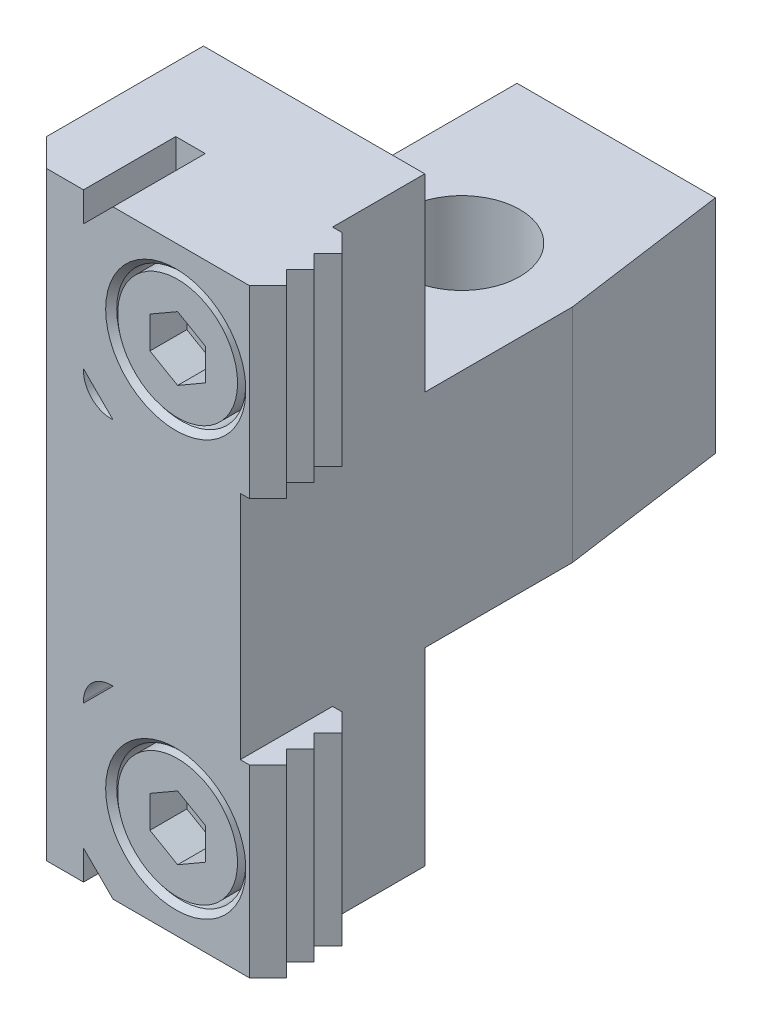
ISO-10303-21;
HEADER;
FILE_DESCRIPTION(('STEP AP214'),'2;1');
FILE_NAME('part.step','',(''),(''),'','','');
FILE_SCHEMA(('AUTOMOTIVE_DESIGN { 1 0 10303 214 1 1 1 1 }'));
ENDSEC;
DATA;
#1=APPLICATION_CONTEXT('core data for automotive mechanical design processes');
#2=APPLICATION_PROTOCOL_DEFINITION('international standard','automotive_design',2000,#1);
#3=PRODUCT_CONTEXT('',#1,'mechanical');
#4=PRODUCT('Part','Part','',(#3));
#5=PRODUCT_RELATED_PRODUCT_CATEGORY('part','',(#4));
#6=PRODUCT_DEFINITION_FORMATION('','',#4);
#7=PRODUCT_DEFINITION_CONTEXT('part definition',#1,'design');
#8=PRODUCT_DEFINITION('design','',#6,#7);
#9=PRODUCT_DEFINITION_SHAPE('','',#8);
#10=(LENGTH_UNIT() NAMED_UNIT(*) SI_UNIT(.MILLI.,.METRE.));
#11=(NAMED_UNIT(*) PLANE_ANGLE_UNIT() SI_UNIT($,.RADIAN.));
#12=(NAMED_UNIT(*) SI_UNIT($,.STERADIAN.) SOLID_ANGLE_UNIT());
#13=UNCERTAINTY_MEASURE_WITH_UNIT(LENGTH_MEASURE(1.E-05),#10,'distance_accuracy_value','');
#14=(GEOMETRIC_REPRESENTATION_CONTEXT(3) GLOBAL_UNCERTAINTY_ASSIGNED_CONTEXT((#13)) GLOBAL_UNIT_ASSIGNED_CONTEXT((#10,
#11,#12)) REPRESENTATION_CONTEXT('',''));
#15=CARTESIAN_POINT('',(0.,0.,0.));
#16=DIRECTION('',(0.,0.,1.));
#17=DIRECTION('',(1.,0.,0.));
#18=AXIS2_PLACEMENT_3D('',#15,#16,#17);
#19=CARTESIAN_POINT('',(4.99999999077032,22.500000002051,32.8));
#20=DIRECTION('',(0.,0.,1.));
#21=DIRECTION('',(1.,0.,0.));
#22=AXIS2_PLACEMENT_3D('',#19,#20,#21);
#23=CYLINDRICAL_SURFACE('',#22,6.5);
#24=CARTESIAN_POINT('',(4.99999999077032,22.500000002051,35.8));
#25=DIRECTION('',(0.,0.,1.));
#26=DIRECTION('',(1.,0.,0.));
#27=AXIS2_PLACEMENT_3D('',#24,#25,#26);
#28=CIRCLE('',#27,6.5);
#29=CARTESIAN_POINT('',(11.4999999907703,22.500000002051,35.8));
#30=VERTEX_POINT('',#29);
#31=EDGE_CURVE('E719',#30,#30,#28,.T.);
#32=ORIENTED_EDGE('',*,*,#31,.F.);
#33=EDGE_LOOP('',(#32));
#34=FACE_BOUND('',#33,.T.);
#35=CARTESIAN_POINT('',(4.99999999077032,22.500000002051,30.8));
#36=DIRECTION('',(0.,0.,-1.));
#37=DIRECTION('',(-1.,0.,0.));
#38=AXIS2_PLACEMENT_3D('',#35,#36,#37);
#39=CIRCLE('',#38,6.5);
#40=CARTESIAN_POINT('',(-1.50000000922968,22.500000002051,30.8));
#41=VERTEX_POINT('',#40);
#42=EDGE_CURVE('E1632',#41,#41,#39,.T.);
#43=ORIENTED_EDGE('',*,*,#42,.F.);
#44=EDGE_LOOP('',(#43));
#45=FACE_BOUND('',#44,.T.);
#46=ADVANCED_FACE('F15',(#34,#45),#23,.T.);
#47=CARTESIAN_POINT('',(4.99999999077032,25.9641016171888,31.8));
#48=DIRECTION('',(-0.5,-0.866025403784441,0.));
#49=DIRECTION('',(0.86602540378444,-0.5,0.));
#50=AXIS2_PLACEMENT_3D('',#47,#48,#49);
#51=PLANE('',#50);
#52=DIRECTION('',(0.,0.,1.));
#53=VECTOR('',#52,1.);
#54=CARTESIAN_POINT('',(7.99999999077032,24.2320508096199,31.8));
#55=LINE('',#54,#53);
#56=CARTESIAN_POINT('',(7.99999999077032,24.2320508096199,31.8));
#57=VERTEX_POINT('',#56);
#58=CARTESIAN_POINT('',(7.99999999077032,24.2320508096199,35.8));
#59=VERTEX_POINT('',#58);
#60=EDGE_CURVE('E1686',#57,#59,#55,.T.);
#61=ORIENTED_EDGE('',*,*,#60,.T.);
#62=DIRECTION('',(0.86602540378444,-0.5,0.));
#63=VECTOR('',#62,1.);
#64=CARTESIAN_POINT('',(4.99999999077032,25.9641016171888,35.8));
#65=LINE('',#64,#63);
#66=CARTESIAN_POINT('',(4.99999999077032,25.9641016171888,35.8));
#67=VERTEX_POINT('',#66);
#68=EDGE_CURVE('E35',#67,#59,#65,.T.);
#69=ORIENTED_EDGE('',*,*,#68,.F.);
#70=DIRECTION('',(0.,0.,1.));
#71=VECTOR('',#70,1.);
#72=CARTESIAN_POINT('',(4.99999999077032,25.9641016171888,31.8));
#73=LINE('',#72,#71);
#74=CARTESIAN_POINT('',(4.99999999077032,25.9641016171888,31.8));
#75=VERTEX_POINT('',#74);
#76=EDGE_CURVE('E1658',#75,#67,#73,.T.);
#77=ORIENTED_EDGE('',*,*,#76,.F.);
#78=DIRECTION('',(0.86602540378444,-0.5,0.));
#79=VECTOR('',#78,1.);
#80=CARTESIAN_POINT('',(4.99999999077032,25.9641016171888,31.8));
#81=LINE('',#80,#79);
#82=EDGE_CURVE('E1641',#75,#57,#81,.T.);
#83=ORIENTED_EDGE('',*,*,#82,.T.);
#84=EDGE_LOOP('',(#61,#69,#77,#83));
#85=FACE_BOUND('',#84,.T.);
#86=ADVANCED_FACE('F1557',(#85),#51,.T.);
#87=CARTESIAN_POINT('',(7.99999999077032,20.7679491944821,31.8));
#88=DIRECTION('',(1.,0.,0.));
#89=DIRECTION('',(0.,0.,-1.));
#90=AXIS2_PLACEMENT_3D('',#87,#88,#89);
#91=PLANE('',#90);
#92=DIRECTION('',(0.,0.,1.));
#93=VECTOR('',#92,1.);
#94=CARTESIAN_POINT('',(7.99999999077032,20.7679491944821,31.8));
#95=LINE('',#94,#93);
#96=CARTESIAN_POINT('',(7.99999999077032,20.7679491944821,31.8));
#97=VERTEX_POINT('',#96);
#98=CARTESIAN_POINT('',(7.99999999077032,20.7679491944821,35.8));
#99=VERTEX_POINT('',#98);
#100=EDGE_CURVE('E1683',#97,#99,#95,.T.);
#101=ORIENTED_EDGE('',*,*,#100,.T.);
#102=DIRECTION('',(0.,1.,0.));
#103=VECTOR('',#102,1.);
#104=CARTESIAN_POINT('',(7.99999999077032,20.7679491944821,35.8));
#105=LINE('',#104,#103);
#106=EDGE_CURVE('E1651',#99,#59,#105,.T.);
#107=ORIENTED_EDGE('',*,*,#106,.T.);
#108=ORIENTED_EDGE('',*,*,#60,.F.);
#109=DIRECTION('',(0.,1.,0.));
#110=VECTOR('',#109,1.);
#111=CARTESIAN_POINT('',(7.99999999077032,20.7679491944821,31.8));
#112=LINE('',#111,#110);
#113=EDGE_CURVE('E1668',#97,#57,#112,.T.);
#114=ORIENTED_EDGE('',*,*,#113,.F.);
#115=EDGE_LOOP('',(#101,#107,#108,#114));
#116=FACE_BOUND('',#115,.T.);
#117=ADVANCED_FACE('F1547',(#116),#91,.F.);
#118=CARTESIAN_POINT('',(4.99999999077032,19.0358983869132,31.8));
#119=DIRECTION('',(0.5,-0.866025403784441,0.));
#120=DIRECTION('',(0.86602540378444,0.5,0.));
#121=AXIS2_PLACEMENT_3D('',#118,#119,#120);
#122=PLANE('',#121);
#123=DIRECTION('',(0.,0.,1.));
#124=VECTOR('',#123,1.);
#125=CARTESIAN_POINT('',(4.99999999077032,19.0358983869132,31.8));
#126=LINE('',#125,#124);
#127=CARTESIAN_POINT('',(4.99999999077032,19.0358983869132,31.8));
#128=VERTEX_POINT('',#127);
#129=CARTESIAN_POINT('',(4.99999999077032,19.0358983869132,35.8));
#130=VERTEX_POINT('',#129);
#131=EDGE_CURVE('E1680',#128,#130,#126,.T.);
#132=ORIENTED_EDGE('',*,*,#131,.T.);
#133=DIRECTION('',(0.86602540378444,0.5,0.));
#134=VECTOR('',#133,1.);
#135=CARTESIAN_POINT('',(4.99999999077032,19.0358983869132,35.8));
#136=LINE('',#135,#134);
#137=EDGE_CURVE('E1648',#130,#99,#136,.T.);
#138=ORIENTED_EDGE('',*,*,#137,.T.);
#139=ORIENTED_EDGE('',*,*,#100,.F.);
#140=DIRECTION('',(0.86602540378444,0.5,0.));
#141=VECTOR('',#140,1.);
#142=CARTESIAN_POINT('',(4.99999999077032,19.0358983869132,31.8));
#143=LINE('',#142,#141);
#144=EDGE_CURVE('E1665',#128,#97,#143,.T.);
#145=ORIENTED_EDGE('',*,*,#144,.F.);
#146=EDGE_LOOP('',(#132,#138,#139,#145));
#147=FACE_BOUND('',#146,.T.);
#148=ADVANCED_FACE('F1537',(#147),#122,.F.);
#149=CARTESIAN_POINT('',(4.99999999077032,19.0358983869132,31.8));
#150=DIRECTION('',(0.5,0.866025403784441,0.));
#151=DIRECTION('',(-0.86602540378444,0.5,0.));
#152=AXIS2_PLACEMENT_3D('',#149,#150,#151);
#153=PLANE('',#152);
#154=DIRECTION('',(0.,0.,1.));
#155=VECTOR('',#154,1.);
#156=CARTESIAN_POINT('',(1.99999999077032,20.7679491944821,31.8));
#157=LINE('',#156,#155);
#158=CARTESIAN_POINT('',(1.99999999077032,20.7679491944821,31.8));
#159=VERTEX_POINT('',#158);
#160=CARTESIAN_POINT('',(1.99999999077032,20.7679491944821,35.8));
#161=VERTEX_POINT('',#160);
#162=EDGE_CURVE('E1677',#159,#161,#157,.T.);
#163=ORIENTED_EDGE('',*,*,#162,.T.);
#164=DIRECTION('',(-0.86602540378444,0.5,0.));
#165=VECTOR('',#164,1.);
#166=CARTESIAN_POINT('',(4.99999999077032,19.0358983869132,35.8));
#167=LINE('',#166,#165);
#168=EDGE_CURVE('E1645',#130,#161,#167,.T.);
#169=ORIENTED_EDGE('',*,*,#168,.F.);
#170=ORIENTED_EDGE('',*,*,#131,.F.);
#171=DIRECTION('',(-0.86602540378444,0.5,0.));
#172=VECTOR('',#171,1.);
#173=CARTESIAN_POINT('',(4.99999999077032,19.0358983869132,31.8));
#174=LINE('',#173,#172);
#175=EDGE_CURVE('E1662',#128,#159,#174,.T.);
#176=ORIENTED_EDGE('',*,*,#175,.T.);
#177=EDGE_LOOP('',(#163,#169,#170,#176));
#178=FACE_BOUND('',#177,.T.);
#179=ADVANCED_FACE('F1527',(#178),#153,.T.);
#180=CARTESIAN_POINT('',(1.99999999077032,24.2320508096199,31.8));
#181=DIRECTION('',(-1.,0.,0.));
#182=DIRECTION('',(0.,-1.,0.));
#183=AXIS2_PLACEMENT_3D('',#180,#181,#182);
#184=PLANE('',#183);
#185=DIRECTION('',(0.,0.,1.));
#186=VECTOR('',#185,1.);
#187=CARTESIAN_POINT('',(1.99999999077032,24.2320508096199,31.8));
#188=LINE('',#187,#186);
#189=CARTESIAN_POINT('',(1.99999999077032,24.2320508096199,31.8));
#190=VERTEX_POINT('',#189);
#191=CARTESIAN_POINT('',(1.99999999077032,24.2320508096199,35.8));
#192=VERTEX_POINT('',#191);
#193=EDGE_CURVE('E1674',#190,#192,#188,.T.);
#194=ORIENTED_EDGE('',*,*,#193,.T.);
#195=DIRECTION('',(0.,-1.,0.));
#196=VECTOR('',#195,1.);
#197=CARTESIAN_POINT('',(1.99999999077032,24.2320508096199,35.8));
#198=LINE('',#197,#196);
#199=EDGE_CURVE('E1642',#192,#161,#198,.T.);
#200=ORIENTED_EDGE('',*,*,#199,.T.);
#201=ORIENTED_EDGE('',*,*,#162,.F.);
#202=DIRECTION('',(0.,-1.,0.));
#203=VECTOR('',#202,1.);
#204=CARTESIAN_POINT('',(1.99999999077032,24.2320508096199,31.8));
#205=LINE('',#204,#203);
#206=EDGE_CURVE('E1659',#190,#159,#205,.T.);
#207=ORIENTED_EDGE('',*,*,#206,.F.);
#208=EDGE_LOOP('',(#194,#200,#201,#207));
#209=FACE_BOUND('',#208,.T.);
#210=ADVANCED_FACE('F1510',(#209),#184,.F.);
#211=CARTESIAN_POINT('',(4.99999999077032,25.9641016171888,31.8));
#212=DIRECTION('',(-0.5,0.866025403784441,0.));
#213=DIRECTION('',(-0.86602540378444,-0.5,0.));
#214=AXIS2_PLACEMENT_3D('',#211,#212,#213);
#215=PLANE('',#214);
#216=DIRECTION('',(-0.86602540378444,-0.5,0.));
#217=VECTOR('',#216,1.);
#218=CARTESIAN_POINT('',(4.99999999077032,25.9641016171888,31.8));
#219=LINE('',#218,#217);
#220=EDGE_CURVE('E1655',#75,#190,#219,.T.);
#221=ORIENTED_EDGE('',*,*,#220,.F.);
#222=ORIENTED_EDGE('',*,*,#76,.T.);
#223=DIRECTION('',(-0.86602540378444,-0.5,0.));
#224=VECTOR('',#223,1.);
#225=CARTESIAN_POINT('',(4.99999999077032,25.9641016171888,35.8));
#226=LINE('',#225,#224);
#227=EDGE_CURVE('E1638',#67,#192,#226,.T.);
#228=ORIENTED_EDGE('',*,*,#227,.T.);
#229=ORIENTED_EDGE('',*,*,#193,.F.);
#230=EDGE_LOOP('',(#221,#222,#228,#229));
#231=FACE_BOUND('',#230,.T.);
#232=ADVANCED_FACE('F853',(#231),#215,.F.);
#233=CARTESIAN_POINT('',(1.99999999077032,27.6961524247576,31.8));
#234=DIRECTION('',(0.,0.,-1.));
#235=DIRECTION('',(-1.,0.,0.));
#236=AXIS2_PLACEMENT_3D('',#233,#234,#235);
#237=PLANE('',#236);
#238=ORIENTED_EDGE('',*,*,#82,.F.);
#239=ORIENTED_EDGE('',*,*,#220,.T.);
#240=ORIENTED_EDGE('',*,*,#206,.T.);
#241=ORIENTED_EDGE('',*,*,#175,.F.);
#242=ORIENTED_EDGE('',*,*,#144,.T.);
#243=ORIENTED_EDGE('',*,*,#113,.T.);
#244=EDGE_LOOP('',(#238,#239,#240,#241,#242,#243));
#245=FACE_BOUND('',#244,.T.);
#246=ADVANCED_FACE('F850',(#245),#237,.F.);
#247=CARTESIAN_POINT('',(4.99999999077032,22.500000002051,35.8));
#248=DIRECTION('',(0.,0.,1.));
#249=DIRECTION('',(1.,0.,0.));
#250=AXIS2_PLACEMENT_3D('',#247,#248,#249);
#251=PLANE('',#250);
#252=ORIENTED_EDGE('',*,*,#31,.T.);
#253=EDGE_LOOP('',(#252));
#254=FACE_BOUND('',#253,.T.);
#255=ORIENTED_EDGE('',*,*,#227,.F.);
#256=ORIENTED_EDGE('',*,*,#68,.T.);
#257=ORIENTED_EDGE('',*,*,#106,.F.);
#258=ORIENTED_EDGE('',*,*,#137,.F.);
#259=ORIENTED_EDGE('',*,*,#168,.T.);
#260=ORIENTED_EDGE('',*,*,#199,.F.);
#261=EDGE_LOOP('',(#255,#256,#257,#258,#259,#260));
#262=FACE_BOUND('',#261,.T.);
#263=ADVANCED_FACE('F837',(#254,#262),#251,.T.);
#264=CARTESIAN_POINT('',(4.99999999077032,22.500000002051,18.8));
#265=DIRECTION('',(0.,0.,-1.));
#266=DIRECTION('',(-1.,0.,0.));
#267=AXIS2_PLACEMENT_3D('',#264,#265,#266);
#268=PLANE('',#267);
#269=CARTESIAN_POINT('',(4.99999999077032,22.500000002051,18.8));
#270=DIRECTION('',(0.,0.,-1.));
#271=DIRECTION('',(-1.,0.,0.));
#272=AXIS2_PLACEMENT_3D('',#269,#270,#271);
#273=CIRCLE('',#272,4.);
#274=CARTESIAN_POINT('',(0.99999999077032,22.500000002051,18.8));
#275=VERTEX_POINT('',#274);
#276=EDGE_CURVE('E466',#275,#275,#273,.T.);
#277=ORIENTED_EDGE('',*,*,#276,.T.);
#278=EDGE_LOOP('',(#277));
#279=FACE_BOUND('',#278,.T.);
#280=ADVANCED_FACE('F834',(#279),#268,.T.);
#281=CARTESIAN_POINT('',(2.00000000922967,-17.3038475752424,31.8));
#282=DIRECTION('',(0.,0.,-1.));
#283=DIRECTION('',(-1.,0.,0.));
#284=AXIS2_PLACEMENT_3D('',#281,#282,#283);
#285=PLANE('',#284);
#286=DIRECTION('',(0.86602540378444,-0.5,0.));
#287=VECTOR('',#286,1.);
#288=CARTESIAN_POINT('',(5.00000000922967,-19.0358983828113,31.8));
#289=LINE('',#288,#287);
#290=CARTESIAN_POINT('',(5.00000000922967,-19.0358983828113,31.8));
#291=VERTEX_POINT('',#290);
#292=CARTESIAN_POINT('',(8.00000000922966,-20.7679491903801,31.8));
#293=VERTEX_POINT('',#292);
#294=EDGE_CURVE('E664',#291,#293,#289,.T.);
#295=ORIENTED_EDGE('',*,*,#294,.F.);
#296=DIRECTION('',(-0.86602540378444,-0.5,0.));
#297=VECTOR('',#296,1.);
#298=CARTESIAN_POINT('',(5.00000000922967,-19.0358983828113,31.8));
#299=LINE('',#298,#297);
#300=CARTESIAN_POINT('',(2.00000000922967,-20.7679491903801,31.8));
#301=VERTEX_POINT('',#300);
#302=EDGE_CURVE('E679',#291,#301,#299,.T.);
#303=ORIENTED_EDGE('',*,*,#302,.T.);
#304=DIRECTION('',(0.,-1.,0.));
#305=VECTOR('',#304,1.);
#306=CARTESIAN_POINT('',(2.00000000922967,-20.7679491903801,31.8));
#307=LINE('',#306,#305);
#308=CARTESIAN_POINT('',(2.00000000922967,-24.2320508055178,31.8));
#309=VERTEX_POINT('',#308);
#310=EDGE_CURVE('E683',#301,#309,#307,.T.);
#311=ORIENTED_EDGE('',*,*,#310,.T.);
#312=DIRECTION('',(-0.86602540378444,0.5,0.));
#313=VECTOR('',#312,1.);
#314=CARTESIAN_POINT('',(5.00000000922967,-25.9641016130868,31.8));
#315=LINE('',#314,#313);
#316=CARTESIAN_POINT('',(5.00000000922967,-25.9641016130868,31.8));
#317=VERTEX_POINT('',#316);
#318=EDGE_CURVE('E686',#317,#309,#315,.T.);
#319=ORIENTED_EDGE('',*,*,#318,.F.);
#320=DIRECTION('',(0.86602540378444,0.5,0.));
#321=VECTOR('',#320,1.);
#322=CARTESIAN_POINT('',(5.00000000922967,-25.9641016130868,31.8));
#323=LINE('',#322,#321);
#324=CARTESIAN_POINT('',(8.00000000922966,-24.2320508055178,31.8));
#325=VERTEX_POINT('',#324);
#326=EDGE_CURVE('E689',#317,#325,#323,.T.);
#327=ORIENTED_EDGE('',*,*,#326,.T.);
#328=DIRECTION('',(0.,1.,0.));
#329=VECTOR('',#328,1.);
#330=CARTESIAN_POINT('',(8.00000000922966,-24.2320508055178,31.8));
#331=LINE('',#330,#329);
#332=EDGE_CURVE('E692',#325,#293,#331,.T.);
#333=ORIENTED_EDGE('',*,*,#332,.T.);
#334=EDGE_LOOP('',(#295,#303,#311,#319,#327,#333));
#335=FACE_BOUND('',#334,.T.);
#336=ADVANCED_FACE('F836',(#335),#285,.F.);
#337=CARTESIAN_POINT('',(2.00000000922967,-20.7679491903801,31.8));
#338=DIRECTION('',(-1.,0.,0.));
#339=DIRECTION('',(0.,-1.,0.));
#340=AXIS2_PLACEMENT_3D('',#337,#338,#339);
#341=PLANE('',#340);
#342=DIRECTION('',(0.,0.,1.));
#343=VECTOR('',#342,1.);
#344=CARTESIAN_POINT('',(2.00000000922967,-20.7679491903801,31.8));
#345=LINE('',#344,#343);
#346=CARTESIAN_POINT('',(2.00000000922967,-20.7679491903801,35.8));
#347=VERTEX_POINT('',#346);
#348=EDGE_CURVE('E699',#301,#347,#345,.T.);
#349=ORIENTED_EDGE('',*,*,#348,.T.);
#350=DIRECTION('',(0.,-1.,0.));
#351=VECTOR('',#350,1.);
#352=CARTESIAN_POINT('',(2.00000000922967,-20.7679491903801,35.8));
#353=LINE('',#352,#351);
#354=CARTESIAN_POINT('',(2.00000000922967,-24.2320508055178,35.8));
#355=VERTEX_POINT('',#354);
#356=EDGE_CURVE('E665',#347,#355,#353,.T.);
#357=ORIENTED_EDGE('',*,*,#356,.T.);
#358=DIRECTION('',(0.,0.,1.));
#359=VECTOR('',#358,1.);
#360=CARTESIAN_POINT('',(2.00000000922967,-24.2320508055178,31.8));
#361=LINE('',#360,#359);
#362=EDGE_CURVE('E701',#309,#355,#361,.T.);
#363=ORIENTED_EDGE('',*,*,#362,.F.);
#364=ORIENTED_EDGE('',*,*,#310,.F.);
#365=EDGE_LOOP('',(#349,#357,#363,#364));
#366=FACE_BOUND('',#365,.T.);
#367=ADVANCED_FACE('F846',(#366),#341,.F.);
#368=CARTESIAN_POINT('',(5.00000000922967,-25.9641016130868,31.8));
#369=DIRECTION('',(0.5,0.866025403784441,0.));
#370=DIRECTION('',(-0.86602540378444,0.5,0.));
#371=AXIS2_PLACEMENT_3D('',#368,#369,#370);
#372=PLANE('',#371);
#373=ORIENTED_EDGE('',*,*,#362,.T.);
#374=DIRECTION('',(-0.86602540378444,0.5,0.));
#375=VECTOR('',#374,1.);
#376=CARTESIAN_POINT('',(5.00000000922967,-25.9641016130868,35.8));
#377=LINE('',#376,#375);
#378=CARTESIAN_POINT('',(5.00000000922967,-25.9641016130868,35.8));
#379=VERTEX_POINT('',#378);
#380=EDGE_CURVE('E668',#379,#355,#377,.T.);
#381=ORIENTED_EDGE('',*,*,#380,.F.);
#382=DIRECTION('',(0.,0.,1.));
#383=VECTOR('',#382,1.);
#384=CARTESIAN_POINT('',(5.00000000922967,-25.9641016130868,31.8));
#385=LINE('',#384,#383);
#386=EDGE_CURVE('E703',#317,#379,#385,.T.);
#387=ORIENTED_EDGE('',*,*,#386,.F.);
#388=ORIENTED_EDGE('',*,*,#318,.T.);
#389=EDGE_LOOP('',(#373,#381,#387,#388));
#390=FACE_BOUND('',#389,.T.);
#391=ADVANCED_FACE('F1484',(#390),#372,.T.);
#392=CARTESIAN_POINT('',(5.00000000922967,-25.9641016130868,31.8));
#393=DIRECTION('',(0.5,-0.866025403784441,0.));
#394=DIRECTION('',(0.86602540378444,0.5,0.));
#395=AXIS2_PLACEMENT_3D('',#392,#393,#394);
#396=PLANE('',#395);
#397=ORIENTED_EDGE('',*,*,#386,.T.);
#398=DIRECTION('',(0.86602540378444,0.5,0.));
#399=VECTOR('',#398,1.);
#400=CARTESIAN_POINT('',(5.00000000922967,-25.9641016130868,35.8));
#401=LINE('',#400,#399);
#402=CARTESIAN_POINT('',(8.00000000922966,-24.2320508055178,35.8));
#403=VERTEX_POINT('',#402);
#404=EDGE_CURVE('E671',#379,#403,#401,.T.);
#405=ORIENTED_EDGE('',*,*,#404,.T.);
#406=DIRECTION('',(0.,0.,1.));
#407=VECTOR('',#406,1.);
#408=CARTESIAN_POINT('',(8.00000000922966,-24.2320508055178,31.8));
#409=LINE('',#408,#407);
#410=EDGE_CURVE('E705',#325,#403,#409,.T.);
#411=ORIENTED_EDGE('',*,*,#410,.F.);
#412=ORIENTED_EDGE('',*,*,#326,.F.);
#413=EDGE_LOOP('',(#397,#405,#411,#412));
#414=FACE_BOUND('',#413,.T.);
#415=ADVANCED_FACE('F1474',(#414),#396,.F.);
#416=CARTESIAN_POINT('',(8.00000000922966,-24.2320508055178,31.8));
#417=DIRECTION('',(1.,0.,0.));
#418=DIRECTION('',(0.,0.,-1.));
#419=AXIS2_PLACEMENT_3D('',#416,#417,#418);
#420=PLANE('',#419);
#421=ORIENTED_EDGE('',*,*,#410,.T.);
#422=DIRECTION('',(0.,1.,0.));
#423=VECTOR('',#422,1.);
#424=CARTESIAN_POINT('',(8.00000000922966,-24.2320508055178,35.8));
#425=LINE('',#424,#423);
#426=CARTESIAN_POINT('',(8.00000000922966,-20.7679491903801,35.8));
#427=VERTEX_POINT('',#426);
#428=EDGE_CURVE('E674',#403,#427,#425,.T.);
#429=ORIENTED_EDGE('',*,*,#428,.T.);
#430=DIRECTION('',(0.,0.,1.));
#431=VECTOR('',#430,1.);
#432=CARTESIAN_POINT('',(8.00000000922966,-20.7679491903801,31.8));
#433=LINE('',#432,#431);
#434=EDGE_CURVE('E707',#293,#427,#433,.T.);
#435=ORIENTED_EDGE('',*,*,#434,.F.);
#436=ORIENTED_EDGE('',*,*,#332,.F.);
#437=EDGE_LOOP('',(#421,#429,#435,#436));
#438=FACE_BOUND('',#437,.T.);
#439=ADVANCED_FACE('F1464',(#438),#420,.F.);
#440=CARTESIAN_POINT('',(5.00000000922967,-19.0358983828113,31.8));
#441=DIRECTION('',(-0.5,-0.866025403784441,0.));
#442=DIRECTION('',(0.86602540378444,-0.5,0.));
#443=AXIS2_PLACEMENT_3D('',#440,#441,#442);
#444=PLANE('',#443);
#445=ORIENTED_EDGE('',*,*,#434,.T.);
#446=DIRECTION('',(0.86602540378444,-0.5,0.));
#447=VECTOR('',#446,1.);
#448=CARTESIAN_POINT('',(5.00000000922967,-19.0358983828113,35.8));
#449=LINE('',#448,#447);
#450=CARTESIAN_POINT('',(5.00000000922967,-19.0358983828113,35.8));
#451=VERTEX_POINT('',#450);
#452=EDGE_CURVE('E660',#451,#427,#449,.T.);
#453=ORIENTED_EDGE('',*,*,#452,.F.);
#454=DIRECTION('',(0.,0.,1.));
#455=VECTOR('',#454,1.);
#456=CARTESIAN_POINT('',(5.00000000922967,-19.0358983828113,31.8));
#457=LINE('',#456,#455);
#458=EDGE_CURVE('E682',#291,#451,#457,.T.);
#459=ORIENTED_EDGE('',*,*,#458,.F.);
#460=ORIENTED_EDGE('',*,*,#294,.T.);
#461=EDGE_LOOP('',(#445,#453,#459,#460));
#462=FACE_BOUND('',#461,.T.);
#463=ADVANCED_FACE('F867',(#462),#444,.T.);
#464=CARTESIAN_POINT('',(5.00000000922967,-19.0358983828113,31.8));
#465=DIRECTION('',(-0.5,0.866025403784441,0.));
#466=DIRECTION('',(-0.86602540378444,-0.5,0.));
#467=AXIS2_PLACEMENT_3D('',#464,#465,#466);
#468=PLANE('',#467);
#469=ORIENTED_EDGE('',*,*,#302,.F.);
#470=ORIENTED_EDGE('',*,*,#458,.T.);
#471=DIRECTION('',(-0.86602540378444,-0.5,0.));
#472=VECTOR('',#471,1.);
#473=CARTESIAN_POINT('',(5.00000000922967,-19.0358983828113,35.8));
#474=LINE('',#473,#472);
#475=EDGE_CURVE('E661',#451,#347,#474,.T.);
#476=ORIENTED_EDGE('',*,*,#475,.T.);
#477=ORIENTED_EDGE('',*,*,#348,.F.);
#478=EDGE_LOOP('',(#469,#470,#476,#477));
#479=FACE_BOUND('',#478,.T.);
#480=ADVANCED_FACE('F849',(#479),#468,.F.);
#481=CARTESIAN_POINT('',(5.00000000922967,-22.499999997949,35.8));
#482=DIRECTION('',(0.,0.,1.));
#483=DIRECTION('',(1.,0.,0.));
#484=AXIS2_PLACEMENT_3D('',#481,#482,#483);
#485=PLANE('',#484);
#486=CARTESIAN_POINT('',(5.00000000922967,-22.499999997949,35.8));
#487=DIRECTION('',(0.,0.,1.));
#488=DIRECTION('',(1.,0.,0.));
#489=AXIS2_PLACEMENT_3D('',#486,#487,#488);
#490=CIRCLE('',#489,6.5);
#491=CARTESIAN_POINT('',(11.5000000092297,-22.499999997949,35.8));
#492=VERTEX_POINT('',#491);
#493=EDGE_CURVE('E360',#492,#492,#490,.T.);
#494=ORIENTED_EDGE('',*,*,#493,.T.);
#495=EDGE_LOOP('',(#494));
#496=FACE_BOUND('',#495,.T.);
#497=ORIENTED_EDGE('',*,*,#475,.F.);
#498=ORIENTED_EDGE('',*,*,#452,.T.);
#499=ORIENTED_EDGE('',*,*,#428,.F.);
#500=ORIENTED_EDGE('',*,*,#404,.F.);
#501=ORIENTED_EDGE('',*,*,#380,.T.);
#502=ORIENTED_EDGE('',*,*,#356,.F.);
#503=EDGE_LOOP('',(#497,#498,#499,#500,#501,#502));
#504=FACE_BOUND('',#503,.T.);
#505=ADVANCED_FACE('F840',(#496,#504),#485,.T.);
#506=CARTESIAN_POINT('',(5.00000000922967,-22.499999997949,32.8));
#507=DIRECTION('',(0.,0.,1.));
#508=DIRECTION('',(1.,0.,0.));
#509=AXIS2_PLACEMENT_3D('',#506,#507,#508);
#510=CYLINDRICAL_SURFACE('',#509,6.5);
#511=ORIENTED_EDGE('',*,*,#493,.F.);
#512=EDGE_LOOP('',(#511));
#513=FACE_BOUND('',#512,.T.);
#514=CARTESIAN_POINT('',(5.00000000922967,-22.499999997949,30.8));
#515=DIRECTION('',(0.,0.,-1.));
#516=DIRECTION('',(-1.,0.,0.));
#517=AXIS2_PLACEMENT_3D('',#514,#515,#516);
#518=CIRCLE('',#517,6.5);
#519=CARTESIAN_POINT('',(-1.49999999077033,-22.499999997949,30.8));
#520=VERTEX_POINT('',#519);
#521=EDGE_CURVE('E654',#520,#520,#518,.T.);
#522=ORIENTED_EDGE('',*,*,#521,.F.);
#523=EDGE_LOOP('',(#522));
#524=FACE_BOUND('',#523,.T.);
#525=ADVANCED_FACE('F857',(#513,#524),#510,.T.);
#526=CARTESIAN_POINT('',(-1.99999999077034,-22.5000000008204,30.8));
#527=DIRECTION('',(0.,0.,-1.));
#528=DIRECTION('',(1.,4.10206425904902E-10,0.));
#529=AXIS2_PLACEMENT_3D('',#526,#527,#528);
#530=PLANE('',#529);
#531=CARTESIAN_POINT('',(5.00000000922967,-22.499999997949,30.8));
#532=DIRECTION('',(0.,0.,1.));
#533=DIRECTION('',(-1.,-4.10206425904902E-10,0.));
#534=AXIS2_PLACEMENT_3D('',#531,#532,#533);
#535=CIRCLE('',#534,7.);
#536=CARTESIAN_POINT('',(-1.99999999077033,-22.5000000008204,30.8));
#537=VERTEX_POINT('',#536);
#538=EDGE_CURVE('E350',#537,#537,#535,.T.);
#539=ORIENTED_EDGE('',*,*,#538,.T.);
#540=EDGE_LOOP('',(#539));
#541=FACE_BOUND('',#540,.T.);
#542=ORIENTED_EDGE('',*,*,#521,.T.);
#543=EDGE_LOOP('',(#542));
#544=FACE_BOUND('',#543,.T.);
#545=ADVANCED_FACE('F813',(#541,#544),#530,.F.);
#546=CARTESIAN_POINT('',(5.00000000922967,-22.499999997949,36.));
#547=DIRECTION('',(0.,0.,1.));
#548=DIRECTION('',(-1.,-4.10206425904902E-10,0.));
#549=AXIS2_PLACEMENT_3D('',#546,#547,#548);
#550=CYLINDRICAL_SURFACE('',#549,7.);
#551=ORIENTED_EDGE('',*,*,#538,.F.);
#552=EDGE_LOOP('',(#551));
#553=FACE_BOUND('',#552,.T.);
#554=CARTESIAN_POINT('',(5.00000000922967,-22.499999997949,35.3999998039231));
#555=DIRECTION('',(0.,0.,1.));
#556=DIRECTION('',(-1.,-4.10206425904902E-10,0.));
#557=AXIS2_PLACEMENT_3D('',#554,#555,#556);
#558=CIRCLE('',#557,7.);
#559=CARTESIAN_POINT('',(-1.99999999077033,-22.5000000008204,35.3999998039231));
#560=VERTEX_POINT('',#559);
#561=EDGE_CURVE('E363',#560,#560,#558,.T.);
#562=ORIENTED_EDGE('',*,*,#561,.T.);
#563=EDGE_LOOP('',(#562));
#564=FACE_BOUND('',#563,.T.);
#565=ADVANCED_FACE('F941',(#553,#564),#550,.F.);
#566=CARTESIAN_POINT('',(5.00000000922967,-22.499999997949,18.8));
#567=DIRECTION('',(0.,0.,-1.));
#568=DIRECTION('',(-1.,0.,0.));
#569=AXIS2_PLACEMENT_3D('',#566,#567,#568);
#570=PLANE('',#569);
#571=CARTESIAN_POINT('',(5.00000000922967,-22.499999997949,18.8));
#572=DIRECTION('',(0.,0.,-1.));
#573=DIRECTION('',(-1.,0.,0.));
#574=AXIS2_PLACEMENT_3D('',#571,#572,#573);
#575=CIRCLE('',#574,4.);
#576=CARTESIAN_POINT('',(1.00000000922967,-22.499999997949,18.8));
#577=VERTEX_POINT('',#576);
#578=EDGE_CURVE('E647',#577,#577,#575,.T.);
#579=ORIENTED_EDGE('',*,*,#578,.T.);
#580=EDGE_LOOP('',(#579));
#581=FACE_BOUND('',#580,.T.);
#582=ADVANCED_FACE('F827',(#581),#570,.T.);
#583=CARTESIAN_POINT('',(11.9999999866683,32.5000000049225,26.));
#584=DIRECTION('',(0.,0.,1.));
#585=DIRECTION('',(-1.,-4.10206857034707E-10,0.));
#586=AXIS2_PLACEMENT_3D('',#583,#584,#585);
#587=PLANE('',#586);
#588=DIRECTION('',(0.707106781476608,-0.707106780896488,0.));
#589=VECTOR('',#588,1.);
#590=CARTESIAN_POINT('',(-1.80000000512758,12.4999999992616,26.));
#591=LINE('',#590,#589);
#592=CARTESIAN_POINT('',(-5.00000000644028,15.699999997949,26.));
#593=VERTEX_POINT('',#592);
#594=CARTESIAN_POINT('',(-1.80000000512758,12.4999999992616,26.));
#595=VERTEX_POINT('',#594);
#596=EDGE_CURVE('E780',#593,#595,#591,.T.);
#597=ORIENTED_EDGE('',*,*,#596,.F.);
#598=DIRECTION('',(4.10207160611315E-10,-1.,0.));
#599=VECTOR('',#598,1.);
#600=CARTESIAN_POINT('',(-5.00000001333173,32.4999999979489,26.));
#601=LINE('',#600,#599);
#602=CARTESIAN_POINT('',(-5.00000000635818,15.499999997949,26.));
#603=VERTEX_POINT('',#602);
#604=EDGE_CURVE('E481',#593,#603,#601,.T.);
#605=ORIENTED_EDGE('',*,*,#604,.T.);
#606=CARTESIAN_POINT('',(-2.00000000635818,15.4999999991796,26.));
#607=DIRECTION('',(0.,0.,1.));
#608=DIRECTION('',(-1.,-4.10206857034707E-10,0.));
#609=AXIS2_PLACEMENT_3D('',#606,#607,#608);
#610=CIRCLE('',#609,3.);
#611=CARTESIAN_POINT('',(-2.00000000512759,12.4999999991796,26.));
#612=VERTEX_POINT('',#611);
#613=EDGE_CURVE('E574',#603,#612,#610,.T.);
#614=ORIENTED_EDGE('',*,*,#613,.T.);
#615=DIRECTION('',(1.,4.10206857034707E-10,0.));
#616=VECTOR('',#615,1.);
#617=CARTESIAN_POINT('',(11.9999999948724,12.5000000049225,26.));
#618=LINE('',#617,#616);
#619=EDGE_CURVE('E485',#612,#595,#618,.T.);
#620=ORIENTED_EDGE('',*,*,#619,.T.);
#621=EDGE_LOOP('',(#597,#605,#614,#620));
#622=FACE_BOUND('',#621,.T.);
#623=ADVANCED_FACE('F803',(#622),#587,.T.);
#624=CARTESIAN_POINT('',(12.0000000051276,-12.4999999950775,26.));
#625=DIRECTION('',(0.,0.,1.));
#626=DIRECTION('',(-1.,-4.10206857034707E-10,0.));
#627=AXIS2_PLACEMENT_3D('',#624,#625,#626);
#628=PLANE('',#627);
#629=DIRECTION('',(-0.707106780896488,-0.707106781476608,0.));
#630=VECTOR('',#629,1.);
#631=CARTESIAN_POINT('',(-4.99999999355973,-15.700000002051,26.));
#632=LINE('',#631,#630);
#633=CARTESIAN_POINT('',(-1.79999999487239,-12.5000000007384,26.));
#634=VERTEX_POINT('',#633);
#635=CARTESIAN_POINT('',(-4.99999999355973,-15.700000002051,26.));
#636=VERTEX_POINT('',#635);
#637=EDGE_CURVE('E422',#634,#636,#632,.T.);
#638=ORIENTED_EDGE('',*,*,#637,.F.);
#639=DIRECTION('',(-1.,-4.10206857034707E-10,0.));
#640=VECTOR('',#639,1.);
#641=CARTESIAN_POINT('',(12.0000000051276,-12.4999999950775,26.));
#642=LINE('',#641,#640);
#643=CARTESIAN_POINT('',(-1.99999999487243,-12.5000000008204,26.));
#644=VERTEX_POINT('',#643);
#645=EDGE_CURVE('E496',#634,#644,#642,.T.);
#646=ORIENTED_EDGE('',*,*,#645,.T.);
#647=CARTESIAN_POINT('',(-1.99999999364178,-15.5000000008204,26.));
#648=DIRECTION('',(0.,0.,1.));
#649=DIRECTION('',(-1.,-4.10206857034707E-10,0.));
#650=AXIS2_PLACEMENT_3D('',#647,#648,#649);
#651=CIRCLE('',#650,3.);
#652=CARTESIAN_POINT('',(-4.99999999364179,-15.5000000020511,26.));
#653=VERTEX_POINT('',#652);
#654=EDGE_CURVE('E566',#644,#653,#651,.T.);
#655=ORIENTED_EDGE('',*,*,#654,.T.);
#656=DIRECTION('',(4.10206553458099E-10,-1.,0.));
#657=VECTOR('',#656,1.);
#658=CARTESIAN_POINT('',(-4.99999998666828,-32.500000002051,26.));
#659=LINE('',#658,#657);
#660=EDGE_CURVE('E502',#653,#636,#659,.T.);
#661=ORIENTED_EDGE('',*,*,#660,.T.);
#662=EDGE_LOOP('',(#638,#646,#655,#661));
#663=FACE_BOUND('',#662,.T.);
#664=ADVANCED_FACE('F826',(#663),#628,.T.);
#665=CARTESIAN_POINT('',(-4.99999999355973,-15.700000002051,36.));
#666=DIRECTION('',(0.707106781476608,-0.707106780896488,0.));
#667=DIRECTION('',(0.707106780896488,0.707106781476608,0.));
#668=AXIS2_PLACEMENT_3D('',#665,#666,#667);
#669=PLANE('',#668);
#670=ORIENTED_EDGE('',*,*,#637,.T.);
#671=DIRECTION('',(0.,0.,-1.));
#672=VECTOR('',#671,1.);
#673=CARTESIAN_POINT('',(-4.99999999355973,-15.700000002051,36.));
#674=LINE('',#673,#672);
#675=CARTESIAN_POINT('',(-4.99999999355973,-15.700000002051,36.));
#676=VERTEX_POINT('',#675);
#677=EDGE_CURVE('E445',#676,#636,#674,.T.);
#678=ORIENTED_EDGE('',*,*,#677,.F.);
#679=DIRECTION('',(-0.707106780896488,-0.707106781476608,0.));
#680=VECTOR('',#679,1.);
#681=CARTESIAN_POINT('',(-4.99999999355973,-15.700000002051,36.));
#682=LINE('',#681,#680);
#683=CARTESIAN_POINT('',(-1.79999999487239,-12.5000000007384,36.));
#684=VERTEX_POINT('',#683);
#685=EDGE_CURVE('E432',#684,#676,#682,.T.);
#686=ORIENTED_EDGE('',*,*,#685,.F.);
#687=DIRECTION('',(0.,0.,-1.));
#688=VECTOR('',#687,1.);
#689=CARTESIAN_POINT('',(-1.79999999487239,-12.5000000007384,36.));
#690=LINE('',#689,#688);
#691=EDGE_CURVE('E447',#684,#634,#690,.T.);
#692=ORIENTED_EDGE('',*,*,#691,.T.);
#693=EDGE_LOOP('',(#670,#678,#686,#692));
#694=FACE_BOUND('',#693,.T.);
#695=ADVANCED_FACE('F891',(#694),#669,.F.);
#696=CARTESIAN_POINT('',(5.00000000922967,-22.499999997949,36.));
#697=DIRECTION('',(0.,0.,1.));
#698=DIRECTION('',(-1.,-4.10206425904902E-10,0.));
#699=AXIS2_PLACEMENT_3D('',#696,#697,#698);
#700=CONICAL_SURFACE('',#699,7.6,0.785398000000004);
#701=ORIENTED_EDGE('',*,*,#561,.F.);
#702=EDGE_LOOP('',(#701));
#703=FACE_BOUND('',#702,.T.);
#704=CARTESIAN_POINT('',(5.00000000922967,-22.499999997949,36.));
#705=DIRECTION('',(0.,0.,1.));
#706=DIRECTION('',(-1.,-4.10206425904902E-10,0.));
#707=AXIS2_PLACEMENT_3D('',#704,#705,#706);
#708=CIRCLE('',#707,7.6);
#709=CARTESIAN_POINT('',(-2.59999999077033,-22.5000000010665,36.));
#710=VERTEX_POINT('',#709);
#711=EDGE_CURVE('E366',#710,#710,#708,.T.);
#712=ORIENTED_EDGE('',*,*,#711,.T.);
#713=EDGE_LOOP('',(#712));
#714=FACE_BOUND('',#713,.T.);
#715=ADVANCED_FACE('F946',(#703,#714),#700,.F.);
#716=CARTESIAN_POINT('',(-1.79999998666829,-32.5000000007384,36.));
#717=DIRECTION('',(0.707106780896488,0.707106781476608,0.));
#718=DIRECTION('',(-0.707106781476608,0.707106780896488,0.));
#719=AXIS2_PLACEMENT_3D('',#716,#717,#718);
#720=PLANE('',#719);
#721=DIRECTION('',(0.707106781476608,-0.707106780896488,0.));
#722=VECTOR('',#721,1.);
#723=CARTESIAN_POINT('',(-1.79999998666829,-32.5000000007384,26.));
#724=LINE('',#723,#722);
#725=CARTESIAN_POINT('',(-4.99999998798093,-29.300000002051,26.));
#726=VERTEX_POINT('',#725);
#727=CARTESIAN_POINT('',(-1.79999998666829,-32.5000000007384,26.));
#728=VERTEX_POINT('',#727);
#729=EDGE_CURVE('E425',#726,#728,#724,.T.);
#730=ORIENTED_EDGE('',*,*,#729,.T.);
#731=DIRECTION('',(0.,0.,-1.));
#732=VECTOR('',#731,1.);
#733=CARTESIAN_POINT('',(-1.79999998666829,-32.5000000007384,36.));
#734=LINE('',#733,#732);
#735=CARTESIAN_POINT('',(-1.79999998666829,-32.5000000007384,36.));
#736=VERTEX_POINT('',#735);
#737=EDGE_CURVE('E440',#736,#728,#734,.T.);
#738=ORIENTED_EDGE('',*,*,#737,.F.);
#739=DIRECTION('',(0.707106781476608,-0.707106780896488,0.));
#740=VECTOR('',#739,1.);
#741=CARTESIAN_POINT('',(-1.79999998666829,-32.5000000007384,36.));
#742=LINE('',#741,#740);
#743=CARTESIAN_POINT('',(-4.99999998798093,-29.300000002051,36.));
#744=VERTEX_POINT('',#743);
#745=EDGE_CURVE('E435',#744,#736,#742,.T.);
#746=ORIENTED_EDGE('',*,*,#745,.F.);
#747=DIRECTION('',(0.,0.,-1.));
#748=VECTOR('',#747,1.);
#749=CARTESIAN_POINT('',(-4.99999998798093,-29.300000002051,36.));
#750=LINE('',#749,#748);
#751=EDGE_CURVE('E443',#744,#726,#750,.T.);
#752=ORIENTED_EDGE('',*,*,#751,.T.);
#753=EDGE_LOOP('',(#730,#738,#746,#752));
#754=FACE_BOUND('',#753,.T.);
#755=ADVANCED_FACE('F603',(#754),#720,.F.);
#756=CARTESIAN_POINT('',(-1.80000000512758,12.4999999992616,36.));
#757=DIRECTION('',(0.707106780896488,0.707106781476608,0.));
#758=DIRECTION('',(-0.707106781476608,0.707106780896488,0.));
#759=AXIS2_PLACEMENT_3D('',#756,#757,#758);
#760=PLANE('',#759);
#761=ORIENTED_EDGE('',*,*,#596,.T.);
#762=DIRECTION('',(0.,0.,-1.));
#763=VECTOR('',#762,1.);
#764=CARTESIAN_POINT('',(-1.80000000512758,12.4999999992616,36.));
#765=LINE('',#764,#763);
#766=CARTESIAN_POINT('',(-1.80000000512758,12.4999999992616,36.));
#767=VERTEX_POINT('',#766);
#768=EDGE_CURVE('E629',#767,#595,#765,.T.);
#769=ORIENTED_EDGE('',*,*,#768,.F.);
#770=DIRECTION('',(0.707106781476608,-0.707106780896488,0.));
#771=VECTOR('',#770,1.);
#772=CARTESIAN_POINT('',(-1.80000000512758,12.4999999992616,36.));
#773=LINE('',#772,#771);
#774=CARTESIAN_POINT('',(-5.00000000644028,15.699999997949,36.));
#775=VERTEX_POINT('',#774);
#776=EDGE_CURVE('E630',#775,#767,#773,.T.);
#777=ORIENTED_EDGE('',*,*,#776,.F.);
#778=DIRECTION('',(0.,0.,-1.));
#779=VECTOR('',#778,1.);
#780=CARTESIAN_POINT('',(-5.00000000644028,15.699999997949,36.));
#781=LINE('',#780,#779);
#782=EDGE_CURVE('E632',#775,#593,#781,.T.);
#783=ORIENTED_EDGE('',*,*,#782,.T.);
#784=EDGE_LOOP('',(#761,#769,#777,#783));
#785=FACE_BOUND('',#784,.T.);
#786=ADVANCED_FACE('F917',(#785),#760,.F.);
#787=CARTESIAN_POINT('',(-5.00000001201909,29.2999999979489,36.));
#788=DIRECTION('',(0.707106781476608,-0.707106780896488,0.));
#789=DIRECTION('',(0.707106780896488,0.707106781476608,0.));
#790=AXIS2_PLACEMENT_3D('',#787,#788,#789);
#791=PLANE('',#790);
#792=DIRECTION('',(-0.707106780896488,-0.707106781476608,0.));
#793=VECTOR('',#792,1.);
#794=CARTESIAN_POINT('',(-5.00000001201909,29.2999999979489,26.));
#795=LINE('',#794,#793);
#796=CARTESIAN_POINT('',(-1.80000001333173,32.4999999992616,26.));
#797=VERTEX_POINT('',#796);
#798=CARTESIAN_POINT('',(-5.00000001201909,29.2999999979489,26.));
#799=VERTEX_POINT('',#798);
#800=EDGE_CURVE('E777',#797,#799,#795,.T.);
#801=ORIENTED_EDGE('',*,*,#800,.T.);
#802=DIRECTION('',(0.,0.,-1.));
#803=VECTOR('',#802,1.);
#804=CARTESIAN_POINT('',(-5.00000001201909,29.2999999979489,36.));
#805=LINE('',#804,#803);
#806=CARTESIAN_POINT('',(-5.00000001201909,29.2999999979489,36.));
#807=VERTEX_POINT('',#806);
#808=EDGE_CURVE('E640',#807,#799,#805,.T.);
#809=ORIENTED_EDGE('',*,*,#808,.F.);
#810=DIRECTION('',(-0.707106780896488,-0.707106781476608,0.));
#811=VECTOR('',#810,1.);
#812=CARTESIAN_POINT('',(-5.00000001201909,29.2999999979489,36.));
#813=LINE('',#812,#811);
#814=CARTESIAN_POINT('',(-1.80000001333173,32.4999999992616,36.));
#815=VERTEX_POINT('',#814);
#816=EDGE_CURVE('E635',#815,#807,#813,.T.);
#817=ORIENTED_EDGE('',*,*,#816,.F.);
#818=DIRECTION('',(0.,0.,-1.));
#819=VECTOR('',#818,1.);
#820=CARTESIAN_POINT('',(-1.80000001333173,32.4999999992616,36.));
#821=LINE('',#820,#819);
#822=EDGE_CURVE('E642',#815,#797,#821,.T.);
#823=ORIENTED_EDGE('',*,*,#822,.T.);
#824=EDGE_LOOP('',(#801,#809,#817,#823));
#825=FACE_BOUND('',#824,.T.);
#826=ADVANCED_FACE('F791',(#825),#791,.F.);
#827=CARTESIAN_POINT('',(5.00000000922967,-22.499999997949,26.));
#828=DIRECTION('',(0.,0.,1.));
#829=DIRECTION('',(-1.,-4.10206857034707E-10,0.));
#830=AXIS2_PLACEMENT_3D('',#827,#828,#829);
#831=CYLINDRICAL_SURFACE('',#830,4.);
#832=ORIENTED_EDGE('',*,*,#578,.F.);
#833=EDGE_LOOP('',(#832));
#834=FACE_BOUND('',#833,.T.);
#835=CARTESIAN_POINT('',(5.00000000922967,-22.499999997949,16.));
#836=DIRECTION('',(0.,0.,1.));
#837=DIRECTION('',(-1.,-4.10206857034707E-10,0.));
#838=AXIS2_PLACEMENT_3D('',#835,#836,#837);
#839=CIRCLE('',#838,4.);
#840=CARTESIAN_POINT('',(1.00000000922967,-22.4999999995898,16.));
#841=VERTEX_POINT('',#840);
#842=EDGE_CURVE('E463',#841,#841,#839,.T.);
#843=ORIENTED_EDGE('',*,*,#842,.F.);
#844=EDGE_LOOP('',(#843));
#845=FACE_BOUND('',#844,.T.);
#846=ADVANCED_FACE('F925',(#834,#845),#831,.F.);
#847=ORIENTED_EDGE('',*,*,#729,.F.);
#848=CARTESIAN_POINT('',(-4.99999998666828,-32.500000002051,26.));
#849=VERTEX_POINT('',#848);
#850=EDGE_CURVE('E501',#726,#849,#659,.T.);
#851=ORIENTED_EDGE('',*,*,#850,.T.);
#852=DIRECTION('',(1.,4.10206857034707E-10,0.));
#853=VECTOR('',#852,1.);
#854=CARTESIAN_POINT('',(12.0000000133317,-32.4999999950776,26.));
#855=LINE('',#854,#853);
#856=EDGE_CURVE('E505',#849,#728,#855,.T.);
#857=ORIENTED_EDGE('',*,*,#856,.T.);
#858=EDGE_LOOP('',(#847,#851,#857));
#859=FACE_BOUND('',#858,.T.);
#860=ADVANCED_FACE('F972',(#859),#628,.T.);
#861=CARTESIAN_POINT('',(13.0000000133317,-32.4999999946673,26.));
#862=DIRECTION('',(-0.707106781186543,-2.90059745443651E-10,0.707106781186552));
#863=DIRECTION('',(-0.707106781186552,-2.90059745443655E-10,-0.707106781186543));
#864=AXIS2_PLACEMENT_3D('',#861,#862,#863);
#865=PLANE('',#864);
#866=DIRECTION('',(0.707106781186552,2.90059745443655E-10,0.707106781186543));
#867=VECTOR('',#866,1.);
#868=CARTESIAN_POINT('',(13.0000000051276,-12.4999999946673,26.));
#869=LINE('',#868,#867);
#870=CARTESIAN_POINT('',(13.0000000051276,-12.4999999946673,26.));
#871=VERTEX_POINT('',#870);
#872=CARTESIAN_POINT('',(15.0000000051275,-12.4999999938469,28.));
#873=VERTEX_POINT('',#872);
#874=EDGE_CURVE('E369',#871,#873,#869,.T.);
#875=ORIENTED_EDGE('',*,*,#874,.T.);
#876=DIRECTION('',(-4.10206425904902E-10,1.,0.));
#877=VECTOR('',#876,1.);
#878=CARTESIAN_POINT('',(15.0000000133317,-32.4999999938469,28.));
#879=LINE('',#878,#877);
#880=CARTESIAN_POINT('',(15.0000000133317,-32.4999999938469,28.));
#881=VERTEX_POINT('',#880);
#882=EDGE_CURVE('E417',#881,#873,#879,.T.);
#883=ORIENTED_EDGE('',*,*,#882,.F.);
#884=DIRECTION('',(0.707106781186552,2.90059745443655E-10,0.707106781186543));
#885=VECTOR('',#884,1.);
#886=CARTESIAN_POINT('',(13.0000000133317,-32.4999999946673,26.));
#887=LINE('',#886,#885);
#888=CARTESIAN_POINT('',(13.0000000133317,-32.4999999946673,26.));
#889=VERTEX_POINT('',#888);
#890=EDGE_CURVE('E386',#889,#881,#887,.T.);
#891=ORIENTED_EDGE('',*,*,#890,.F.);
#892=DIRECTION('',(-4.10206425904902E-10,1.,0.));
#893=VECTOR('',#892,1.);
#894=CARTESIAN_POINT('',(13.0000000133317,-32.4999999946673,26.));
#895=LINE('',#894,#893);
#896=EDGE_CURVE('E404',#889,#871,#895,.T.);
#897=ORIENTED_EDGE('',*,*,#896,.T.);
#898=EDGE_LOOP('',(#875,#883,#891,#897));
#899=FACE_BOUND('',#898,.T.);
#900=ADVANCED_FACE('F958',(#899),#865,.F.);
#901=CARTESIAN_POINT('',(15.0000000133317,-32.4999999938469,28.));
#902=DIRECTION('',(-0.70710678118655,-2.90059745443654E-10,-0.707106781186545));
#903=DIRECTION('',(0.707106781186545,2.90059745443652E-10,-0.70710678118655));
#904=AXIS2_PLACEMENT_3D('',#901,#902,#903);
#905=PLANE('',#904);
#906=DIRECTION('',(-0.707106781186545,-2.90059745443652E-10,0.70710678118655));
#907=VECTOR('',#906,1.);
#908=CARTESIAN_POINT('',(15.0000000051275,-12.4999999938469,28.));
#909=LINE('',#908,#907);
#910=CARTESIAN_POINT('',(13.5000000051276,-12.4999999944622,29.5));
#911=VERTEX_POINT('',#910);
#912=EDGE_CURVE('E372',#873,#911,#909,.T.);
#913=ORIENTED_EDGE('',*,*,#912,.T.);
#914=DIRECTION('',(-4.10206425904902E-10,1.,0.));
#915=VECTOR('',#914,1.);
#916=CARTESIAN_POINT('',(13.5000000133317,-32.4999999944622,29.5));
#917=LINE('',#916,#915);
#918=CARTESIAN_POINT('',(13.5000000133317,-32.4999999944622,29.5));
#919=VERTEX_POINT('',#918);
#920=EDGE_CURVE('E415',#919,#911,#917,.T.);
#921=ORIENTED_EDGE('',*,*,#920,.F.);
#922=DIRECTION('',(-0.707106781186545,-2.90059745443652E-10,0.70710678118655));
#923=VECTOR('',#922,1.);
#924=CARTESIAN_POINT('',(15.0000000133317,-32.4999999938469,28.));
#925=LINE('',#924,#923);
#926=EDGE_CURVE('E389',#881,#919,#925,.T.);
#927=ORIENTED_EDGE('',*,*,#926,.F.);
#928=ORIENTED_EDGE('',*,*,#882,.T.);
#929=EDGE_LOOP('',(#913,#921,#927,#928));
#930=FACE_BOUND('',#929,.T.);
#931=ADVANCED_FACE('F965',(#930),#905,.F.);
#932=CARTESIAN_POINT('',(13.5000000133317,-32.4999999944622,29.5));
#933=DIRECTION('',(-0.707106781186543,-2.90059745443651E-10,0.707106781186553));
#934=DIRECTION('',(-0.707106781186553,-2.90059745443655E-10,-0.707106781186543));
#935=AXIS2_PLACEMENT_3D('',#932,#933,#934);
#936=PLANE('',#935);
#937=DIRECTION('',(0.707106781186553,2.90059745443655E-10,0.707106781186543));
#938=VECTOR('',#937,1.);
#939=CARTESIAN_POINT('',(13.5000000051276,-12.4999999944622,29.5));
#940=LINE('',#939,#938);
#941=CARTESIAN_POINT('',(15.0000000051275,-12.4999999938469,31.));
#942=VERTEX_POINT('',#941);
#943=EDGE_CURVE('E375',#911,#942,#940,.T.);
#944=ORIENTED_EDGE('',*,*,#943,.T.);
#945=DIRECTION('',(-4.10206425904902E-10,1.,0.));
#946=VECTOR('',#945,1.);
#947=CARTESIAN_POINT('',(15.0000000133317,-32.4999999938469,31.));
#948=LINE('',#947,#946);
#949=CARTESIAN_POINT('',(15.0000000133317,-32.4999999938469,31.));
#950=VERTEX_POINT('',#949);
#951=EDGE_CURVE('E413',#950,#942,#948,.T.);
#952=ORIENTED_EDGE('',*,*,#951,.F.);
#953=DIRECTION('',(0.707106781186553,2.90059745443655E-10,0.707106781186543));
#954=VECTOR('',#953,1.);
#955=CARTESIAN_POINT('',(13.5000000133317,-32.4999999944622,29.5));
#956=LINE('',#955,#954);
#957=EDGE_CURVE('E392',#919,#950,#956,.T.);
#958=ORIENTED_EDGE('',*,*,#957,.F.);
#959=ORIENTED_EDGE('',*,*,#920,.T.);
#960=EDGE_LOOP('',(#944,#952,#958,#959));
#961=FACE_BOUND('',#960,.T.);
#962=ADVANCED_FACE('F961',(#961),#936,.F.);
#963=CARTESIAN_POINT('',(15.0000000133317,-32.4999999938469,31.));
#964=DIRECTION('',(-0.70710678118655,-2.90059745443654E-10,-0.707106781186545));
#965=DIRECTION('',(0.707106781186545,2.90059745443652E-10,-0.70710678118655));
#966=AXIS2_PLACEMENT_3D('',#963,#964,#965);
#967=PLANE('',#966);
#968=DIRECTION('',(-0.707106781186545,-2.90059745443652E-10,0.70710678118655));
#969=VECTOR('',#968,1.);
#970=CARTESIAN_POINT('',(15.0000000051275,-12.4999999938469,31.));
#971=LINE('',#970,#969);
#972=CARTESIAN_POINT('',(13.5000000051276,-12.4999999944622,32.5));
#973=VERTEX_POINT('',#972);
#974=EDGE_CURVE('E378',#942,#973,#971,.T.);
#975=ORIENTED_EDGE('',*,*,#974,.T.);
#976=DIRECTION('',(-4.10206425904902E-10,1.,0.));
#977=VECTOR('',#976,1.);
#978=CARTESIAN_POINT('',(13.5000000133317,-32.4999999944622,32.5));
#979=LINE('',#978,#977);
#980=CARTESIAN_POINT('',(13.5000000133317,-32.4999999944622,32.5));
#981=VERTEX_POINT('',#980);
#982=EDGE_CURVE('E411',#981,#973,#979,.T.);
#983=ORIENTED_EDGE('',*,*,#982,.F.);
#984=DIRECTION('',(-0.707106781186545,-2.90059745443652E-10,0.70710678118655));
#985=VECTOR('',#984,1.);
#986=CARTESIAN_POINT('',(15.0000000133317,-32.4999999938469,31.));
#987=LINE('',#986,#985);
#988=EDGE_CURVE('E395',#950,#981,#987,.T.);
#989=ORIENTED_EDGE('',*,*,#988,.F.);
#990=ORIENTED_EDGE('',*,*,#951,.T.);
#991=EDGE_LOOP('',(#975,#983,#989,#990));
#992=FACE_BOUND('',#991,.T.);
#993=ADVANCED_FACE('F950',(#992),#967,.F.);
#994=CARTESIAN_POINT('',(13.5000000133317,-32.4999999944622,32.5));
#995=DIRECTION('',(-0.707106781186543,-2.90059745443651E-10,0.707106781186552));
#996=DIRECTION('',(-0.707106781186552,-2.90059745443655E-10,-0.707106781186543));
#997=AXIS2_PLACEMENT_3D('',#994,#995,#996);
#998=PLANE('',#997);
#999=DIRECTION('',(0.707106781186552,2.90059745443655E-10,0.707106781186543));
#1000=VECTOR('',#999,1.);
#1001=CARTESIAN_POINT('',(13.5000000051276,-12.4999999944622,32.5));
#1002=LINE('',#1001,#1000);
#1003=CARTESIAN_POINT('',(15.0000000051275,-12.4999999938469,34.));
#1004=VERTEX_POINT('',#1003);
#1005=EDGE_CURVE('E381',#973,#1004,#1002,.T.);
#1006=ORIENTED_EDGE('',*,*,#1005,.T.);
#1007=DIRECTION('',(-4.10206425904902E-10,1.,0.));
#1008=VECTOR('',#1007,1.);
#1009=CARTESIAN_POINT('',(15.0000000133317,-32.4999999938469,34.));
#1010=LINE('',#1009,#1008);
#1011=CARTESIAN_POINT('',(15.0000000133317,-32.4999999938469,34.));
#1012=VERTEX_POINT('',#1011);
#1013=EDGE_CURVE('E409',#1012,#1004,#1010,.T.);
#1014=ORIENTED_EDGE('',*,*,#1013,.F.);
#1015=DIRECTION('',(0.707106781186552,2.90059745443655E-10,0.707106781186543));
#1016=VECTOR('',#1015,1.);
#1017=CARTESIAN_POINT('',(13.5000000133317,-32.4999999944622,32.5));
#1018=LINE('',#1017,#1016);
#1019=EDGE_CURVE('E398',#981,#1012,#1018,.T.);
#1020=ORIENTED_EDGE('',*,*,#1019,.F.);
#1021=ORIENTED_EDGE('',*,*,#982,.T.);
#1022=EDGE_LOOP('',(#1006,#1014,#1020,#1021));
#1023=FACE_BOUND('',#1022,.T.);
#1024=ADVANCED_FACE('F954',(#1023),#998,.F.);
#1025=CARTESIAN_POINT('',(15.0000000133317,-32.4999999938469,34.));
#1026=DIRECTION('',(-0.70710678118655,-2.90059745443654E-10,-0.707106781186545));
#1027=DIRECTION('',(0.707106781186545,2.90059745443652E-10,-0.70710678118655));
#1028=AXIS2_PLACEMENT_3D('',#1025,#1026,#1027);
#1029=PLANE('',#1028);
#1030=DIRECTION('',(-0.707106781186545,-2.90059745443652E-10,0.70710678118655));
#1031=VECTOR('',#1030,1.);
#1032=CARTESIAN_POINT('',(15.0000000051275,-12.4999999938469,34.));
#1033=LINE('',#1032,#1031);
#1034=CARTESIAN_POINT('',(13.0000000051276,-12.4999999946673,36.));
#1035=VERTEX_POINT('',#1034);
#1036=EDGE_CURVE('E384',#1004,#1035,#1033,.T.);
#1037=ORIENTED_EDGE('',*,*,#1036,.T.);
#1038=DIRECTION('',(-4.10206425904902E-10,1.,0.));
#1039=VECTOR('',#1038,1.);
#1040=CARTESIAN_POINT('',(13.0000000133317,-32.4999999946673,36.));
#1041=LINE('',#1040,#1039);
#1042=CARTESIAN_POINT('',(13.0000000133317,-32.4999999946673,36.));
#1043=VERTEX_POINT('',#1042);
#1044=EDGE_CURVE('E405',#1043,#1035,#1041,.T.);
#1045=ORIENTED_EDGE('',*,*,#1044,.F.);
#1046=DIRECTION('',(-0.707106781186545,-2.90059745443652E-10,0.70710678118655));
#1047=VECTOR('',#1046,1.);
#1048=CARTESIAN_POINT('',(15.0000000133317,-32.4999999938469,34.));
#1049=LINE('',#1048,#1047);
#1050=EDGE_CURVE('E401',#1012,#1043,#1049,.T.);
#1051=ORIENTED_EDGE('',*,*,#1050,.F.);
#1052=ORIENTED_EDGE('',*,*,#1013,.T.);
#1053=EDGE_LOOP('',(#1037,#1045,#1051,#1052));
#1054=FACE_BOUND('',#1053,.T.);
#1055=ADVANCED_FACE('F951',(#1054),#1029,.F.);
#1056=CARTESIAN_POINT('',(-5.00000001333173,32.4999999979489,26.));
#1057=DIRECTION('',(-1.,-4.10207160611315E-10,0.));
#1058=DIRECTION('',(4.10207160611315E-10,-1.,0.));
#1059=AXIS2_PLACEMENT_3D('',#1056,#1057,#1058);
#1060=PLANE('',#1059);
#1061=ORIENTED_EDGE('',*,*,#604,.F.);
#1062=ORIENTED_EDGE('',*,*,#782,.F.);
#1063=DIRECTION('',(4.10207160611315E-10,-1.,0.));
#1064=VECTOR('',#1063,1.);
#1065=CARTESIAN_POINT('',(-5.00000001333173,32.4999999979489,36.));
#1066=LINE('',#1065,#1064);
#1067=CARTESIAN_POINT('',(-5.00000000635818,15.499999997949,36.));
#1068=VERTEX_POINT('',#1067);
#1069=EDGE_CURVE('E472',#775,#1068,#1066,.T.);
#1070=ORIENTED_EDGE('',*,*,#1069,.T.);
#1071=DIRECTION('',(0.,0.,1.));
#1072=VECTOR('',#1071,1.);
#1073=CARTESIAN_POINT('',(-5.00000000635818,15.499999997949,26.));
#1074=LINE('',#1073,#1072);
#1075=EDGE_CURVE('E571',#1068,#603,#1074,.F.);
#1076=ORIENTED_EDGE('',*,*,#1075,.T.);
#1077=EDGE_LOOP('',(#1061,#1062,#1070,#1076));
#1078=FACE_BOUND('',#1077,.T.);
#1079=ADVANCED_FACE('F812',(#1078),#1060,.F.);
#1080=CARTESIAN_POINT('',(-2.00000000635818,15.4999999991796,26.));
#1081=DIRECTION('',(0.,0.,-1.));
#1082=DIRECTION('',(1.,4.10206857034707E-10,0.));
#1083=AXIS2_PLACEMENT_3D('',#1080,#1081,#1082);
#1084=CYLINDRICAL_SURFACE('',#1083,3.);
#1085=ORIENTED_EDGE('',*,*,#613,.F.);
#1086=ORIENTED_EDGE('',*,*,#1075,.F.);
#1087=CARTESIAN_POINT('',(-2.00000000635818,15.4999999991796,36.));
#1088=DIRECTION('',(0.,0.,1.));
#1089=DIRECTION('',(-1.,-4.10206857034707E-10,0.));
#1090=AXIS2_PLACEMENT_3D('',#1087,#1088,#1089);
#1091=CIRCLE('',#1090,3.);
#1092=CARTESIAN_POINT('',(-2.00000000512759,12.4999999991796,36.));
#1093=VERTEX_POINT('',#1092);
#1094=EDGE_CURVE('E579',#1093,#1068,#1091,.F.);
#1095=ORIENTED_EDGE('',*,*,#1094,.F.);
#1096=DIRECTION('',(0.,0.,1.));
#1097=VECTOR('',#1096,1.);
#1098=CARTESIAN_POINT('',(-2.00000000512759,12.4999999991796,36.));
#1099=LINE('',#1098,#1097);
#1100=EDGE_CURVE('E568',#612,#1093,#1099,.T.);
#1101=ORIENTED_EDGE('',*,*,#1100,.F.);
#1102=EDGE_LOOP('',(#1085,#1086,#1095,#1101));
#1103=FACE_BOUND('',#1102,.T.);
#1104=ADVANCED_FACE('F1005',(#1103),#1084,.F.);
#1105=CARTESIAN_POINT('',(11.9999999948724,12.5000000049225,26.));
#1106=DIRECTION('',(4.10206857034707E-10,-1.,0.));
#1107=DIRECTION('',(0.,0.,1.));
#1108=AXIS2_PLACEMENT_3D('',#1105,#1106,#1107);
#1109=PLANE('',#1108);
#1110=DIRECTION('',(1.,4.10206857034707E-10,0.));
#1111=VECTOR('',#1110,1.);
#1112=CARTESIAN_POINT('',(11.9999999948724,12.5000000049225,36.));
#1113=LINE('',#1112,#1111);
#1114=EDGE_CURVE('E476',#1093,#767,#1113,.T.);
#1115=ORIENTED_EDGE('',*,*,#1114,.T.);
#1116=ORIENTED_EDGE('',*,*,#768,.T.);
#1117=ORIENTED_EDGE('',*,*,#619,.F.);
#1118=ORIENTED_EDGE('',*,*,#1100,.T.);
#1119=EDGE_LOOP('',(#1115,#1116,#1117,#1118));
#1120=FACE_BOUND('',#1119,.T.);
#1121=ADVANCED_FACE('F829',(#1120),#1109,.F.);
#1122=CARTESIAN_POINT('',(12.0000000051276,-12.4999999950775,26.));
#1123=DIRECTION('',(-4.10206857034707E-10,1.,0.));
#1124=DIRECTION('',(0.,0.,-1.));
#1125=AXIS2_PLACEMENT_3D('',#1122,#1123,#1124);
#1126=PLANE('',#1125);
#1127=ORIENTED_EDGE('',*,*,#645,.F.);
#1128=ORIENTED_EDGE('',*,*,#691,.F.);
#1129=DIRECTION('',(-1.,-4.10206857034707E-10,0.));
#1130=VECTOR('',#1129,1.);
#1131=CARTESIAN_POINT('',(12.0000000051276,-12.4999999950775,36.));
#1132=LINE('',#1131,#1130);
#1133=CARTESIAN_POINT('',(-1.99999999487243,-12.5000000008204,36.));
#1134=VERTEX_POINT('',#1133);
#1135=EDGE_CURVE('E490',#684,#1134,#1132,.T.);
#1136=ORIENTED_EDGE('',*,*,#1135,.T.);
#1137=DIRECTION('',(0.,0.,1.));
#1138=VECTOR('',#1137,1.);
#1139=CARTESIAN_POINT('',(-1.99999999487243,-12.5000000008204,26.));
#1140=LINE('',#1139,#1138);
#1141=EDGE_CURVE('E563',#1134,#644,#1140,.F.);
#1142=ORIENTED_EDGE('',*,*,#1141,.T.);
#1143=EDGE_LOOP('',(#1127,#1128,#1136,#1142));
#1144=FACE_BOUND('',#1143,.T.);
#1145=ADVANCED_FACE('F1009',(#1144),#1126,.F.);
#1146=CARTESIAN_POINT('',(-1.99999999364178,-15.5000000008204,26.));
#1147=DIRECTION('',(0.,0.,-1.));
#1148=DIRECTION('',(1.,4.10206857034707E-10,0.));
#1149=AXIS2_PLACEMENT_3D('',#1146,#1147,#1148);
#1150=CYLINDRICAL_SURFACE('',#1149,3.);
#1151=ORIENTED_EDGE('',*,*,#654,.F.);
#1152=ORIENTED_EDGE('',*,*,#1141,.F.);
#1153=CARTESIAN_POINT('',(-1.99999999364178,-15.5000000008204,36.));
#1154=DIRECTION('',(0.,0.,1.));
#1155=DIRECTION('',(-1.,-4.10206857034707E-10,0.));
#1156=AXIS2_PLACEMENT_3D('',#1153,#1154,#1155);
#1157=CIRCLE('',#1156,3.);
#1158=CARTESIAN_POINT('',(-4.99999999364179,-15.5000000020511,36.));
#1159=VERTEX_POINT('',#1158);
#1160=EDGE_CURVE('E576',#1159,#1134,#1157,.F.);
#1161=ORIENTED_EDGE('',*,*,#1160,.F.);
#1162=DIRECTION('',(0.,0.,1.));
#1163=VECTOR('',#1162,1.);
#1164=CARTESIAN_POINT('',(-4.99999999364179,-15.5000000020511,36.));
#1165=LINE('',#1164,#1163);
#1166=EDGE_CURVE('E556',#653,#1159,#1165,.T.);
#1167=ORIENTED_EDGE('',*,*,#1166,.F.);
#1168=EDGE_LOOP('',(#1151,#1152,#1161,#1167));
#1169=FACE_BOUND('',#1168,.T.);
#1170=ADVANCED_FACE('F831',(#1169),#1150,.F.);
#1171=CARTESIAN_POINT('',(-4.99999998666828,-32.500000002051,26.));
#1172=DIRECTION('',(-1.,-4.10206553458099E-10,0.));
#1173=DIRECTION('',(4.10206553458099E-10,-1.,0.));
#1174=AXIS2_PLACEMENT_3D('',#1171,#1172,#1173);
#1175=PLANE('',#1174);
#1176=DIRECTION('',(4.10206553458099E-10,-1.,0.));
#1177=VECTOR('',#1176,1.);
#1178=CARTESIAN_POINT('',(-4.99999998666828,-32.500000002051,36.));
#1179=LINE('',#1178,#1177);
#1180=EDGE_CURVE('E493',#1159,#676,#1179,.T.);
#1181=ORIENTED_EDGE('',*,*,#1180,.T.);
#1182=ORIENTED_EDGE('',*,*,#677,.T.);
#1183=ORIENTED_EDGE('',*,*,#660,.F.);
#1184=ORIENTED_EDGE('',*,*,#1166,.T.);
#1185=EDGE_LOOP('',(#1181,#1182,#1183,#1184));
#1186=FACE_BOUND('',#1185,.T.);
#1187=ADVANCED_FACE('F804',(#1186),#1175,.F.);
#1188=ORIENTED_EDGE('',*,*,#850,.F.);
#1189=ORIENTED_EDGE('',*,*,#751,.F.);
#1190=CARTESIAN_POINT('',(-4.99999998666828,-32.500000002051,36.));
#1191=VERTEX_POINT('',#1190);
#1192=EDGE_CURVE('E492',#744,#1191,#1179,.T.);
#1193=ORIENTED_EDGE('',*,*,#1192,.T.);
#1194=DIRECTION('',(0.,0.,1.));
#1195=VECTOR('',#1194,1.);
#1196=CARTESIAN_POINT('',(-4.99999998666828,-32.500000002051,26.));
#1197=LINE('',#1196,#1195);
#1198=EDGE_CURVE('E508',#849,#1191,#1197,.T.);
#1199=ORIENTED_EDGE('',*,*,#1198,.F.);
#1200=EDGE_LOOP('',(#1188,#1189,#1193,#1199));
#1201=FACE_BOUND('',#1200,.T.);
#1202=ADVANCED_FACE('F599',(#1201),#1175,.F.);
#1203=CARTESIAN_POINT('',(4.99999999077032,22.500000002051,36.));
#1204=DIRECTION('',(0.,0.,1.));
#1205=DIRECTION('',(-1.,-4.10206425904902E-10,0.));
#1206=AXIS2_PLACEMENT_3D('',#1203,#1204,#1205);
#1207=CONICAL_SURFACE('',#1206,7.6,0.785398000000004);
#1208=CARTESIAN_POINT('',(4.99999999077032,22.500000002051,35.3999998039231));
#1209=DIRECTION('',(0.,0.,1.));
#1210=DIRECTION('',(-1.,-4.10206425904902E-10,0.));
#1211=AXIS2_PLACEMENT_3D('',#1208,#1209,#1210);
#1212=CIRCLE('',#1211,7.);
#1213=CARTESIAN_POINT('',(-2.00000000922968,22.4999999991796,35.3999998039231));
#1214=VERTEX_POINT('',#1213);
#1215=EDGE_CURVE('E722',#1214,#1214,#1212,.T.);
#1216=ORIENTED_EDGE('',*,*,#1215,.F.);
#1217=EDGE_LOOP('',(#1216));
#1218=FACE_BOUND('',#1217,.T.);
#1219=CARTESIAN_POINT('',(4.99999999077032,22.500000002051,36.));
#1220=DIRECTION('',(0.,0.,1.));
#1221=DIRECTION('',(-1.,-4.10206425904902E-10,0.));
#1222=AXIS2_PLACEMENT_3D('',#1219,#1220,#1221);
#1223=CIRCLE('',#1222,7.6);
#1224=CARTESIAN_POINT('',(-2.60000000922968,22.4999999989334,36.));
#1225=VERTEX_POINT('',#1224);
#1226=EDGE_CURVE('E725',#1225,#1225,#1223,.T.);
#1227=ORIENTED_EDGE('',*,*,#1226,.T.);
#1228=EDGE_LOOP('',(#1227));
#1229=FACE_BOUND('',#1228,.T.);
#1230=ADVANCED_FACE('F889',(#1218,#1229),#1207,.F.);
#1231=CARTESIAN_POINT('',(4.99999999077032,22.500000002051,36.));
#1232=DIRECTION('',(0.,0.,1.));
#1233=DIRECTION('',(-1.,-4.10206425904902E-10,0.));
#1234=AXIS2_PLACEMENT_3D('',#1231,#1232,#1233);
#1235=CYLINDRICAL_SURFACE('',#1234,7.);
#1236=CARTESIAN_POINT('',(4.99999999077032,22.500000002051,30.8));
#1237=DIRECTION('',(0.,0.,1.));
#1238=DIRECTION('',(-1.,-4.10206425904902E-10,0.));
#1239=AXIS2_PLACEMENT_3D('',#1236,#1237,#1238);
#1240=CIRCLE('',#1239,7.);
#1241=CARTESIAN_POINT('',(-2.00000000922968,22.4999999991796,30.8));
#1242=VERTEX_POINT('',#1241);
#1243=EDGE_CURVE('E716',#1242,#1242,#1240,.T.);
#1244=ORIENTED_EDGE('',*,*,#1243,.F.);
#1245=EDGE_LOOP('',(#1244));
#1246=FACE_BOUND('',#1245,.T.);
#1247=ORIENTED_EDGE('',*,*,#1215,.T.);
#1248=EDGE_LOOP('',(#1247));
#1249=FACE_BOUND('',#1248,.T.);
#1250=ADVANCED_FACE('F885',(#1246,#1249),#1235,.F.);
#1251=CARTESIAN_POINT('',(-2.00000000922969,22.4999999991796,30.8));
#1252=DIRECTION('',(0.,0.,-1.));
#1253=DIRECTION('',(1.,4.10206425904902E-10,0.));
#1254=AXIS2_PLACEMENT_3D('',#1251,#1252,#1253);
#1255=PLANE('',#1254);
#1256=ORIENTED_EDGE('',*,*,#1243,.T.);
#1257=EDGE_LOOP('',(#1256));
#1258=FACE_BOUND('',#1257,.T.);
#1259=ORIENTED_EDGE('',*,*,#42,.T.);
#1260=EDGE_LOOP('',(#1259));
#1261=FACE_BOUND('',#1260,.T.);
#1262=ADVANCED_FACE('F881',(#1258,#1261),#1255,.F.);
#1263=CARTESIAN_POINT('',(14.9999999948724,12.5000000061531,34.));
#1264=DIRECTION('',(-0.70710678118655,-2.90059745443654E-10,-0.707106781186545));
#1265=DIRECTION('',(0.707106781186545,2.90059745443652E-10,-0.70710678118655));
#1266=AXIS2_PLACEMENT_3D('',#1263,#1264,#1265);
#1267=PLANE('',#1266);
#1268=DIRECTION('',(-0.707106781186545,-2.90059745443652E-10,0.70710678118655));
#1269=VECTOR('',#1268,1.);
#1270=CARTESIAN_POINT('',(14.9999999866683,32.5000000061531,34.));
#1271=LINE('',#1270,#1269);
#1272=CARTESIAN_POINT('',(14.9999999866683,32.5000000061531,34.));
#1273=VERTEX_POINT('',#1272);
#1274=CARTESIAN_POINT('',(12.9999999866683,32.5000000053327,36.));
#1275=VERTEX_POINT('',#1274);
#1276=EDGE_CURVE('E743',#1273,#1275,#1271,.T.);
#1277=ORIENTED_EDGE('',*,*,#1276,.T.);
#1278=DIRECTION('',(-4.10206425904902E-10,1.,0.));
#1279=VECTOR('',#1278,1.);
#1280=CARTESIAN_POINT('',(12.9999999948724,12.5000000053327,36.));
#1281=LINE('',#1280,#1279);
#1282=CARTESIAN_POINT('',(12.9999999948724,12.5000000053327,36.));
#1283=VERTEX_POINT('',#1282);
#1284=EDGE_CURVE('E761',#1283,#1275,#1281,.T.);
#1285=ORIENTED_EDGE('',*,*,#1284,.F.);
#1286=DIRECTION('',(-0.707106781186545,-2.90059745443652E-10,0.70710678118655));
#1287=VECTOR('',#1286,1.);
#1288=CARTESIAN_POINT('',(14.9999999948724,12.5000000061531,34.));
#1289=LINE('',#1288,#1287);
#1290=CARTESIAN_POINT('',(14.9999999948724,12.5000000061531,34.));
#1291=VERTEX_POINT('',#1290);
#1292=EDGE_CURVE('E628',#1291,#1283,#1289,.T.);
#1293=ORIENTED_EDGE('',*,*,#1292,.F.);
#1294=DIRECTION('',(-4.10206425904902E-10,1.,0.));
#1295=VECTOR('',#1294,1.);
#1296=CARTESIAN_POINT('',(14.9999999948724,12.5000000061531,34.));
#1297=LINE('',#1296,#1295);
#1298=EDGE_CURVE('E764',#1291,#1273,#1297,.T.);
#1299=ORIENTED_EDGE('',*,*,#1298,.T.);
#1300=EDGE_LOOP('',(#1277,#1285,#1293,#1299));
#1301=FACE_BOUND('',#1300,.T.);
#1302=ADVANCED_FACE('F884',(#1301),#1267,.F.);
#1303=CARTESIAN_POINT('',(13.4999999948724,12.5000000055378,32.5));
#1304=DIRECTION('',(-0.707106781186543,-2.90059745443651E-10,0.707106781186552));
#1305=DIRECTION('',(-0.707106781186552,-2.90059745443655E-10,-0.707106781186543));
#1306=AXIS2_PLACEMENT_3D('',#1303,#1304,#1305);
#1307=PLANE('',#1306);
#1308=DIRECTION('',(0.707106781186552,2.90059745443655E-10,0.707106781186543));
#1309=VECTOR('',#1308,1.);
#1310=CARTESIAN_POINT('',(13.4999999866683,32.5000000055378,32.5));
#1311=LINE('',#1310,#1309);
#1312=CARTESIAN_POINT('',(13.4999999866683,32.5000000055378,32.5));
#1313=VERTEX_POINT('',#1312);
#1314=EDGE_CURVE('E740',#1313,#1273,#1311,.T.);
#1315=ORIENTED_EDGE('',*,*,#1314,.T.);
#1316=ORIENTED_EDGE('',*,*,#1298,.F.);
#1317=DIRECTION('',(0.707106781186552,2.90059745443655E-10,0.707106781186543));
#1318=VECTOR('',#1317,1.);
#1319=CARTESIAN_POINT('',(13.4999999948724,12.5000000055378,32.5));
#1320=LINE('',#1319,#1318);
#1321=CARTESIAN_POINT('',(13.4999999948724,12.5000000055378,32.5));
#1322=VERTEX_POINT('',#1321);
#1323=EDGE_CURVE('E757',#1322,#1291,#1320,.T.);
#1324=ORIENTED_EDGE('',*,*,#1323,.F.);
#1325=DIRECTION('',(-4.10206425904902E-10,1.,0.));
#1326=VECTOR('',#1325,1.);
#1327=CARTESIAN_POINT('',(13.4999999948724,12.5000000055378,32.5));
#1328=LINE('',#1327,#1326);
#1329=EDGE_CURVE('E766',#1322,#1313,#1328,.T.);
#1330=ORIENTED_EDGE('',*,*,#1329,.T.);
#1331=EDGE_LOOP('',(#1315,#1316,#1324,#1330));
#1332=FACE_BOUND('',#1331,.T.);
#1333=ADVANCED_FACE('F897',(#1332),#1307,.F.);
#1334=CARTESIAN_POINT('',(14.9999999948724,12.5000000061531,31.));
#1335=DIRECTION('',(-0.70710678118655,-2.90059745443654E-10,-0.707106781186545));
#1336=DIRECTION('',(0.707106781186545,2.90059745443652E-10,-0.70710678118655));
#1337=AXIS2_PLACEMENT_3D('',#1334,#1335,#1336);
#1338=PLANE('',#1337);
#1339=DIRECTION('',(-0.707106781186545,-2.90059745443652E-10,0.70710678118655));
#1340=VECTOR('',#1339,1.);
#1341=CARTESIAN_POINT('',(14.9999999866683,32.5000000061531,31.));
#1342=LINE('',#1341,#1340);
#1343=CARTESIAN_POINT('',(14.9999999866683,32.5000000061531,31.));
#1344=VERTEX_POINT('',#1343);
#1345=EDGE_CURVE('E737',#1344,#1313,#1342,.T.);
#1346=ORIENTED_EDGE('',*,*,#1345,.T.);
#1347=ORIENTED_EDGE('',*,*,#1329,.F.);
#1348=DIRECTION('',(-0.707106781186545,-2.90059745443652E-10,0.70710678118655));
#1349=VECTOR('',#1348,1.);
#1350=CARTESIAN_POINT('',(14.9999999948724,12.5000000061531,31.));
#1351=LINE('',#1350,#1349);
#1352=CARTESIAN_POINT('',(14.9999999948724,12.5000000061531,31.));
#1353=VERTEX_POINT('',#1352);
#1354=EDGE_CURVE('E754',#1353,#1322,#1351,.T.);
#1355=ORIENTED_EDGE('',*,*,#1354,.F.);
#1356=DIRECTION('',(-4.10206425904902E-10,1.,0.));
#1357=VECTOR('',#1356,1.);
#1358=CARTESIAN_POINT('',(14.9999999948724,12.5000000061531,31.));
#1359=LINE('',#1358,#1357);
#1360=EDGE_CURVE('E768',#1353,#1344,#1359,.T.);
#1361=ORIENTED_EDGE('',*,*,#1360,.T.);
#1362=EDGE_LOOP('',(#1346,#1347,#1355,#1361));
#1363=FACE_BOUND('',#1362,.T.);
#1364=ADVANCED_FACE('F901',(#1363),#1338,.F.);
#1365=CARTESIAN_POINT('',(13.4999999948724,12.5000000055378,29.5));
#1366=DIRECTION('',(-0.707106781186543,-2.90059745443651E-10,0.707106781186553));
#1367=DIRECTION('',(-0.707106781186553,-2.90059745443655E-10,-0.707106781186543));
#1368=AXIS2_PLACEMENT_3D('',#1365,#1366,#1367);
#1369=PLANE('',#1368);
#1370=DIRECTION('',(0.707106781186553,2.90059745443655E-10,0.707106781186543));
#1371=VECTOR('',#1370,1.);
#1372=CARTESIAN_POINT('',(13.4999999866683,32.5000000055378,29.5));
#1373=LINE('',#1372,#1371);
#1374=CARTESIAN_POINT('',(13.4999999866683,32.5000000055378,29.5));
#1375=VERTEX_POINT('',#1374);
#1376=EDGE_CURVE('E734',#1375,#1344,#1373,.T.);
#1377=ORIENTED_EDGE('',*,*,#1376,.T.);
#1378=ORIENTED_EDGE('',*,*,#1360,.F.);
#1379=DIRECTION('',(0.707106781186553,2.90059745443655E-10,0.707106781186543));
#1380=VECTOR('',#1379,1.);
#1381=CARTESIAN_POINT('',(13.4999999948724,12.5000000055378,29.5));
#1382=LINE('',#1381,#1380);
#1383=CARTESIAN_POINT('',(13.4999999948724,12.5000000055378,29.5));
#1384=VERTEX_POINT('',#1383);
#1385=EDGE_CURVE('E751',#1384,#1353,#1382,.T.);
#1386=ORIENTED_EDGE('',*,*,#1385,.F.);
#1387=DIRECTION('',(-4.10206425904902E-10,1.,0.));
#1388=VECTOR('',#1387,1.);
#1389=CARTESIAN_POINT('',(13.4999999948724,12.5000000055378,29.5));
#1390=LINE('',#1389,#1388);
#1391=EDGE_CURVE('E770',#1384,#1375,#1390,.T.);
#1392=ORIENTED_EDGE('',*,*,#1391,.T.);
#1393=EDGE_LOOP('',(#1377,#1378,#1386,#1392));
#1394=FACE_BOUND('',#1393,.T.);
#1395=ADVANCED_FACE('F905',(#1394),#1369,.F.);
#1396=CARTESIAN_POINT('',(14.9999999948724,12.5000000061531,28.));
#1397=DIRECTION('',(-0.70710678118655,-2.90059745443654E-10,-0.707106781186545));
#1398=DIRECTION('',(0.707106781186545,2.90059745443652E-10,-0.70710678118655));
#1399=AXIS2_PLACEMENT_3D('',#1396,#1397,#1398);
#1400=PLANE('',#1399);
#1401=DIRECTION('',(-0.707106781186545,-2.90059745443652E-10,0.70710678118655));
#1402=VECTOR('',#1401,1.);
#1403=CARTESIAN_POINT('',(14.9999999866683,32.5000000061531,28.));
#1404=LINE('',#1403,#1402);
#1405=CARTESIAN_POINT('',(14.9999999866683,32.5000000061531,28.));
#1406=VERTEX_POINT('',#1405);
#1407=EDGE_CURVE('E731',#1406,#1375,#1404,.T.);
#1408=ORIENTED_EDGE('',*,*,#1407,.T.);
#1409=ORIENTED_EDGE('',*,*,#1391,.F.);
#1410=DIRECTION('',(-0.707106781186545,-2.90059745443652E-10,0.70710678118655));
#1411=VECTOR('',#1410,1.);
#1412=CARTESIAN_POINT('',(14.9999999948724,12.5000000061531,28.));
#1413=LINE('',#1412,#1411);
#1414=CARTESIAN_POINT('',(14.9999999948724,12.5000000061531,28.));
#1415=VERTEX_POINT('',#1414);
#1416=EDGE_CURVE('E748',#1415,#1384,#1413,.T.);
#1417=ORIENTED_EDGE('',*,*,#1416,.F.);
#1418=DIRECTION('',(-4.10206425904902E-10,1.,0.));
#1419=VECTOR('',#1418,1.);
#1420=CARTESIAN_POINT('',(14.9999999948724,12.5000000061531,28.));
#1421=LINE('',#1420,#1419);
#1422=EDGE_CURVE('E772',#1415,#1406,#1421,.T.);
#1423=ORIENTED_EDGE('',*,*,#1422,.T.);
#1424=EDGE_LOOP('',(#1408,#1409,#1417,#1423));
#1425=FACE_BOUND('',#1424,.T.);
#1426=ADVANCED_FACE('F814',(#1425),#1400,.F.);
#1427=CARTESIAN_POINT('',(12.9999999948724,12.5000000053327,26.));
#1428=DIRECTION('',(-0.707106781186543,-2.90059745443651E-10,0.707106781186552));
#1429=DIRECTION('',(-0.707106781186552,-2.90059745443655E-10,-0.707106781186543));
#1430=AXIS2_PLACEMENT_3D('',#1427,#1428,#1429);
#1431=PLANE('',#1430);
#1432=DIRECTION('',(0.707106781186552,2.90059745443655E-10,0.707106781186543));
#1433=VECTOR('',#1432,1.);
#1434=CARTESIAN_POINT('',(12.9999999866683,32.5000000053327,26.));
#1435=LINE('',#1434,#1433);
#1436=CARTESIAN_POINT('',(12.9999999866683,32.5000000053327,26.));
#1437=VERTEX_POINT('',#1436);
#1438=EDGE_CURVE('E728',#1437,#1406,#1435,.T.);
#1439=ORIENTED_EDGE('',*,*,#1438,.T.);
#1440=ORIENTED_EDGE('',*,*,#1422,.F.);
#1441=DIRECTION('',(0.707106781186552,2.90059745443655E-10,0.707106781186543));
#1442=VECTOR('',#1441,1.);
#1443=CARTESIAN_POINT('',(12.9999999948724,12.5000000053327,26.));
#1444=LINE('',#1443,#1442);
#1445=CARTESIAN_POINT('',(12.9999999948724,12.5000000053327,26.));
#1446=VERTEX_POINT('',#1445);
#1447=EDGE_CURVE('E745',#1446,#1415,#1444,.T.);
#1448=ORIENTED_EDGE('',*,*,#1447,.F.);
#1449=DIRECTION('',(-4.10206425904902E-10,1.,0.));
#1450=VECTOR('',#1449,1.);
#1451=CARTESIAN_POINT('',(12.9999999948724,12.5000000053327,26.));
#1452=LINE('',#1451,#1450);
#1453=EDGE_CURVE('E760',#1446,#1437,#1452,.T.);
#1454=ORIENTED_EDGE('',*,*,#1453,.T.);
#1455=EDGE_LOOP('',(#1439,#1440,#1448,#1454));
#1456=FACE_BOUND('',#1455,.T.);
#1457=ADVANCED_FACE('F800',(#1456),#1431,.F.);
#1458=ORIENTED_EDGE('',*,*,#800,.F.);
#1459=DIRECTION('',(-1.,-4.10206857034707E-10,0.));
#1460=VECTOR('',#1459,1.);
#1461=CARTESIAN_POINT('',(11.9999999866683,32.5000000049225,26.));
#1462=LINE('',#1461,#1460);
#1463=CARTESIAN_POINT('',(-5.00000001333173,32.4999999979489,26.));
#1464=VERTEX_POINT('',#1463);
#1465=EDGE_CURVE('E479',#797,#1464,#1462,.T.);
#1466=ORIENTED_EDGE('',*,*,#1465,.T.);
#1467=EDGE_CURVE('E482',#1464,#799,#601,.T.);
#1468=ORIENTED_EDGE('',*,*,#1467,.T.);
#1469=EDGE_LOOP('',(#1458,#1466,#1468));
#1470=FACE_BOUND('',#1469,.T.);
#1471=ADVANCED_FACE('F798',(#1470),#587,.T.);
#1472=CARTESIAN_POINT('',(-5.00000001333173,32.4999999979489,36.));
#1473=VERTEX_POINT('',#1472);
#1474=EDGE_CURVE('E473',#1473,#807,#1066,.T.);
#1475=ORIENTED_EDGE('',*,*,#1474,.T.);
#1476=ORIENTED_EDGE('',*,*,#808,.T.);
#1477=ORIENTED_EDGE('',*,*,#1467,.F.);
#1478=DIRECTION('',(0.,0.,1.));
#1479=VECTOR('',#1478,1.);
#1480=CARTESIAN_POINT('',(-5.00000001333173,32.4999999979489,26.));
#1481=LINE('',#1480,#1479);
#1482=EDGE_CURVE('E488',#1464,#1473,#1481,.T.);
#1483=ORIENTED_EDGE('',*,*,#1482,.T.);
#1484=EDGE_LOOP('',(#1475,#1476,#1477,#1483));
#1485=FACE_BOUND('',#1484,.T.);
#1486=ADVANCED_FACE('F794',(#1485),#1060,.F.);
#1487=CARTESIAN_POINT('',(-9.00000001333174,32.4999999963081,36.));
#1488=DIRECTION('',(-0.707106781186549,-2.90060239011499E-10,0.707106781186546));
#1489=DIRECTION('',(-0.707106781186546,-2.90060050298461E-10,-0.707106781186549));
#1490=AXIS2_PLACEMENT_3D('',#1487,#1488,#1489);
#1491=PLANE('',#1490);
#1492=DIRECTION('',(0.707106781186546,2.90060050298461E-10,0.707106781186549));
#1493=VECTOR('',#1492,1.);
#1494=CARTESIAN_POINT('',(-9.00000001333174,32.4999999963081,36.));
#1495=LINE('',#1494,#1493);
#1496=CARTESIAN_POINT('',(-12.0000000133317,32.4999999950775,33.));
#1497=VERTEX_POINT('',#1496);
#1498=CARTESIAN_POINT('',(-9.00000001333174,32.4999999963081,36.));
#1499=VERTEX_POINT('',#1498);
#1500=EDGE_CURVE('E19',#1497,#1499,#1495,.T.);
#1501=ORIENTED_EDGE('',*,*,#1500,.F.);
#1502=DIRECTION('',(-4.10207123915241E-10,1.,0.));
#1503=VECTOR('',#1502,1.);
#1504=CARTESIAN_POINT('',(-12.0000000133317,32.4999999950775,33.));
#1505=LINE('',#1504,#1503);
#1506=CARTESIAN_POINT('',(-11.9999999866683,-32.5000000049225,33.));
#1507=VERTEX_POINT('',#1506);
#1508=EDGE_CURVE('E320',#1507,#1497,#1505,.T.);
#1509=ORIENTED_EDGE('',*,*,#1508,.F.);
#1510=DIRECTION('',(-0.707106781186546,-2.90060050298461E-10,-0.707106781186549));
#1511=VECTOR('',#1510,1.);
#1512=CARTESIAN_POINT('',(-8.99999998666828,-32.5000000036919,36.));
#1513=LINE('',#1512,#1511);
#1514=CARTESIAN_POINT('',(-8.99999998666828,-32.5000000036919,36.));
#1515=VERTEX_POINT('',#1514);
#1516=EDGE_CURVE('E315',#1515,#1507,#1513,.T.);
#1517=ORIENTED_EDGE('',*,*,#1516,.F.);
#1518=DIRECTION('',(4.10207123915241E-10,-1.,0.));
#1519=VECTOR('',#1518,1.);
#1520=CARTESIAN_POINT('',(-8.99999998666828,-32.5000000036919,36.));
#1521=LINE('',#1520,#1519);
#1522=EDGE_CURVE('E342',#1499,#1515,#1521,.T.);
#1523=ORIENTED_EDGE('',*,*,#1522,.F.);
#1524=EDGE_LOOP('',(#1501,#1509,#1517,#1523));
#1525=FACE_BOUND('',#1524,.T.);
#1526=ADVANCED_FACE('F340',(#1525),#1491,.T.);
#1527=CARTESIAN_POINT('',(1.33317142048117E-08,-32.5,0.));
#1528=DIRECTION('',(-4.10206857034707E-10,1.,0.));
#1529=DIRECTION('',(0.,0.,-1.));
#1530=AXIS2_PLACEMENT_3D('',#1527,#1528,#1529);
#1531=CYLINDRICAL_SURFACE('',#1530,6.3);
#1532=CARTESIAN_POINT('',(4.92251725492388E-09,-12.,0.));
#1533=DIRECTION('',(-4.10206818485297E-10,1.,0.));
#1534=DIRECTION('',(-1.,-4.10206818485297E-10,0.));
#1535=AXIS2_PLACEMENT_3D('',#1532,#1533,#1534);
#1536=CIRCLE('',#1535,6.3);
#1537=CARTESIAN_POINT('',(-6.29999999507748,-12.0000000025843,0.));
#1538=VERTEX_POINT('',#1537);
#1539=EDGE_CURVE('E526',#1538,#1538,#1536,.F.);
#1540=ORIENTED_EDGE('',*,*,#1539,.T.);
#1541=EDGE_LOOP('',(#1540));
#1542=FACE_BOUND('',#1541,.T.);
#1543=CARTESIAN_POINT('',(-4.92248256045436E-09,12.,0.));
#1544=DIRECTION('',(4.10206818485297E-10,-1.,0.));
#1545=DIRECTION('',(1.,4.10206818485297E-10,0.));
#1546=AXIS2_PLACEMENT_3D('',#1543,#1544,#1545);
#1547=CIRCLE('',#1546,6.3);
#1548=CARTESIAN_POINT('',(6.29999999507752,12.0000000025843,0.));
#1549=VERTEX_POINT('',#1548);
#1550=EDGE_CURVE('E542',#1549,#1549,#1547,.F.);
#1551=ORIENTED_EDGE('',*,*,#1550,.T.);
#1552=EDGE_LOOP('',(#1551));
#1553=FACE_BOUND('',#1552,.T.);
#1554=ADVANCED_FACE('F987',(#1542,#1553),#1531,.F.);
#1555=CARTESIAN_POINT('',(-11.9999999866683,-32.5000000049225,-18.));
#1556=DIRECTION('',(0.,0.,1.));
#1557=DIRECTION('',(-1.,-4.10206857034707E-10,0.));
#1558=AXIS2_PLACEMENT_3D('',#1555,#1556,#1557);
#1559=PLANE('',#1558);
#1560=DIRECTION('',(1.,4.10206857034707E-10,0.));
#1561=VECTOR('',#1560,1.);
#1562=CARTESIAN_POINT('',(-12.0000000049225,11.9999999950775,-18.));
#1563=LINE('',#1562,#1561);
#1564=CARTESIAN_POINT('',(-12.0000000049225,11.9999999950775,-18.));
#1565=VERTEX_POINT('',#1564);
#1566=CARTESIAN_POINT('',(9.49999999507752,12.000000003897,-18.));
#1567=VERTEX_POINT('',#1566);
#1568=EDGE_CURVE('E458',#1565,#1567,#1563,.T.);
#1569=ORIENTED_EDGE('',*,*,#1568,.T.);
#1570=DIRECTION('',(4.10206818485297E-10,-1.,0.));
#1571=VECTOR('',#1570,1.);
#1572=CARTESIAN_POINT('',(9.50000001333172,-32.499999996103,-18.));
#1573=LINE('',#1572,#1571);
#1574=CARTESIAN_POINT('',(9.50000000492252,-11.999999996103,-18.));
#1575=VERTEX_POINT('',#1574);
#1576=EDGE_CURVE('E585',#1567,#1575,#1573,.T.);
#1577=ORIENTED_EDGE('',*,*,#1576,.T.);
#1578=DIRECTION('',(1.,4.10206818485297E-10,0.));
#1579=VECTOR('',#1578,1.);
#1580=CARTESIAN_POINT('',(-11.9999999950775,-12.0000000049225,-18.));
#1581=LINE('',#1580,#1579);
#1582=CARTESIAN_POINT('',(-11.9999999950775,-12.0000000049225,-18.));
#1583=VERTEX_POINT('',#1582);
#1584=EDGE_CURVE('E582',#1583,#1575,#1581,.T.);
#1585=ORIENTED_EDGE('',*,*,#1584,.F.);
#1586=DIRECTION('',(-4.10206818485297E-10,1.,0.));
#1587=VECTOR('',#1586,1.);
#1588=CARTESIAN_POINT('',(-11.9999999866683,-32.5000000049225,-18.));
#1589=LINE('',#1588,#1587);
#1590=EDGE_CURVE('E461',#1583,#1565,#1589,.T.);
#1591=ORIENTED_EDGE('',*,*,#1590,.T.);
#1592=EDGE_LOOP('',(#1569,#1577,#1585,#1591));
#1593=FACE_BOUND('',#1592,.T.);
#1594=ADVANCED_FACE('F992',(#1593),#1559,.F.);
#1595=CARTESIAN_POINT('',(-11.9999999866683,-32.5000000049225,16.));
#1596=DIRECTION('',(0.,0.,1.));
#1597=DIRECTION('',(-1.,-4.10206857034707E-10,0.));
#1598=AXIS2_PLACEMENT_3D('',#1595,#1596,#1597);
#1599=PLANE('',#1598);
#1600=ORIENTED_EDGE('',*,*,#842,.T.);
#1601=EDGE_LOOP('',(#1600));
#1602=FACE_BOUND('',#1601,.T.);
#1603=DIRECTION('',(4.10206772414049E-10,-1.,0.));
#1604=VECTOR('',#1603,1.);
#1605=CARTESIAN_POINT('',(12.0000000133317,-32.4999999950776,16.));
#1606=LINE('',#1605,#1604);
#1607=CARTESIAN_POINT('',(12.0000000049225,-11.9999999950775,16.));
#1608=VERTEX_POINT('',#1607);
#1609=CARTESIAN_POINT('',(12.0000000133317,-32.4999999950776,16.));
#1610=VERTEX_POINT('',#1609);
#1611=EDGE_CURVE('E515',#1608,#1610,#1606,.T.);
#1612=ORIENTED_EDGE('',*,*,#1611,.T.);
#1613=DIRECTION('',(1.,4.10206818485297E-10,0.));
#1614=VECTOR('',#1613,1.);
#1615=CARTESIAN_POINT('',(-11.9999999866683,-32.5000000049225,16.));
#1616=LINE('',#1615,#1614);
#1617=CARTESIAN_POINT('',(-11.9999999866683,-32.5000000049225,16.));
#1618=VERTEX_POINT('',#1617);
#1619=EDGE_CURVE('E523',#1618,#1610,#1616,.T.);
#1620=ORIENTED_EDGE('',*,*,#1619,.F.);
#1621=DIRECTION('',(4.10206772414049E-10,-1.,0.));
#1622=VECTOR('',#1621,1.);
#1623=CARTESIAN_POINT('',(-11.9999999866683,-32.5000000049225,16.));
#1624=LINE('',#1623,#1622);
#1625=CARTESIAN_POINT('',(-11.9999999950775,-12.0000000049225,16.));
#1626=VERTEX_POINT('',#1625);
#1627=EDGE_CURVE('E520',#1626,#1618,#1624,.T.);
#1628=ORIENTED_EDGE('',*,*,#1627,.F.);
#1629=DIRECTION('',(1.,4.10206818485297E-10,0.));
#1630=VECTOR('',#1629,1.);
#1631=CARTESIAN_POINT('',(-11.9999999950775,-12.0000000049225,16.));
#1632=LINE('',#1631,#1630);
#1633=EDGE_CURVE('E522',#1626,#1608,#1632,.T.);
#1634=ORIENTED_EDGE('',*,*,#1633,.T.);
#1635=EDGE_LOOP('',(#1612,#1620,#1628,#1634));
#1636=FACE_BOUND('',#1635,.T.);
#1637=ADVANCED_FACE('F995',(#1602,#1636),#1599,.F.);
#1638=CARTESIAN_POINT('',(12.0000000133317,-32.4999999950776,36.));
#1639=DIRECTION('',(-4.10206857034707E-10,1.,0.));
#1640=DIRECTION('',(0.,0.,-1.));
#1641=AXIS2_PLACEMENT_3D('',#1638,#1639,#1640);
#1642=PLANE('',#1641);
#1643=DIRECTION('',(1.,4.10206857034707E-10,0.));
#1644=VECTOR('',#1643,1.);
#1645=CARTESIAN_POINT('',(12.0000000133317,-32.4999999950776,36.));
#1646=LINE('',#1645,#1644);
#1647=EDGE_CURVE('E549',#1515,#1191,#1646,.T.);
#1648=ORIENTED_EDGE('',*,*,#1647,.F.);
#1649=ORIENTED_EDGE('',*,*,#1516,.T.);
#1650=DIRECTION('',(0.,0.,-1.));
#1651=VECTOR('',#1650,1.);
#1652=CARTESIAN_POINT('',(-11.9999999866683,-32.5000000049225,36.));
#1653=LINE('',#1652,#1651);
#1654=EDGE_CURVE('E327',#1507,#1618,#1653,.T.);
#1655=ORIENTED_EDGE('',*,*,#1654,.T.);
#1656=ORIENTED_EDGE('',*,*,#1619,.T.);
#1657=DIRECTION('',(0.,0.,-1.));
#1658=VECTOR('',#1657,1.);
#1659=CARTESIAN_POINT('',(12.0000000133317,-32.4999999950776,36.));
#1660=LINE('',#1659,#1658);
#1661=CARTESIAN_POINT('',(12.0000000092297,-32.4999999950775,26.));
#1662=VERTEX_POINT('',#1661);
#1663=EDGE_CURVE('E552',#1662,#1610,#1660,.T.);
#1664=ORIENTED_EDGE('',*,*,#1663,.F.);
#1665=DIRECTION('',(1.,4.10206425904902E-10,0.));
#1666=VECTOR('',#1665,1.);
#1667=CARTESIAN_POINT('',(15.0000000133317,-32.4999999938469,26.));
#1668=LINE('',#1667,#1666);
#1669=EDGE_CURVE('E427',#1662,#889,#1668,.T.);
#1670=ORIENTED_EDGE('',*,*,#1669,.T.);
#1671=ORIENTED_EDGE('',*,*,#890,.T.);
#1672=ORIENTED_EDGE('',*,*,#926,.T.);
#1673=ORIENTED_EDGE('',*,*,#957,.T.);
#1674=ORIENTED_EDGE('',*,*,#988,.T.);
#1675=ORIENTED_EDGE('',*,*,#1019,.T.);
#1676=ORIENTED_EDGE('',*,*,#1050,.T.);
#1677=DIRECTION('',(1.,4.10206425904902E-10,0.));
#1678=VECTOR('',#1677,1.);
#1679=CARTESIAN_POINT('',(15.0000000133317,-32.4999999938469,36.));
#1680=LINE('',#1679,#1678);
#1681=EDGE_CURVE('E437',#736,#1043,#1680,.T.);
#1682=ORIENTED_EDGE('',*,*,#1681,.F.);
#1683=ORIENTED_EDGE('',*,*,#737,.T.);
#1684=ORIENTED_EDGE('',*,*,#856,.F.);
#1685=ORIENTED_EDGE('',*,*,#1198,.T.);
#1686=EDGE_LOOP('',(#1648,#1649,#1655,#1656,#1664,#1670,#1671,#1672,#1673,#1674,#1675,#1676,
#1682,#1683,#1684,#1685));
#1687=FACE_BOUND('',#1686,.T.);
#1688=ADVANCED_FACE('F594',(#1687),#1642,.F.);
#1689=CARTESIAN_POINT('',(15.0000000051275,-12.4999999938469,26.));
#1690=DIRECTION('',(0.,0.,1.));
#1691=DIRECTION('',(-1.,-4.10206425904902E-10,0.));
#1692=AXIS2_PLACEMENT_3D('',#1689,#1690,#1691);
#1693=PLANE('',#1692);
#1694=ORIENTED_EDGE('',*,*,#1669,.F.);
#1695=DIRECTION('',(-4.10206770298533E-10,1.,0.));
#1696=VECTOR('',#1695,1.);
#1697=CARTESIAN_POINT('',(12.0000000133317,-32.4999999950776,26.));
#1698=LINE('',#1697,#1696);
#1699=CARTESIAN_POINT('',(12.0000000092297,-12.4999999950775,26.));
#1700=VERTEX_POINT('',#1699);
#1701=EDGE_CURVE('E449',#1662,#1700,#1698,.T.);
#1702=ORIENTED_EDGE('',*,*,#1701,.T.);
#1703=DIRECTION('',(-1.,-4.10206425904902E-10,0.));
#1704=VECTOR('',#1703,1.);
#1705=CARTESIAN_POINT('',(15.0000000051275,-12.4999999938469,26.));
#1706=LINE('',#1705,#1704);
#1707=EDGE_CURVE('E408',#871,#1700,#1706,.T.);
#1708=ORIENTED_EDGE('',*,*,#1707,.F.);
#1709=ORIENTED_EDGE('',*,*,#896,.F.);
#1710=EDGE_LOOP('',(#1694,#1702,#1708,#1709));
#1711=FACE_BOUND('',#1710,.T.);
#1712=ADVANCED_FACE('F974',(#1711),#1693,.F.);
#1713=CARTESIAN_POINT('',(15.0000000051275,-12.4999999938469,36.));
#1714=DIRECTION('',(4.10206425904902E-10,-1.,0.));
#1715=DIRECTION('',(0.,0.,1.));
#1716=AXIS2_PLACEMENT_3D('',#1713,#1714,#1715);
#1717=PLANE('',#1716);
#1718=ORIENTED_EDGE('',*,*,#1707,.T.);
#1719=DIRECTION('',(0.,0.,1.));
#1720=VECTOR('',#1719,1.);
#1721=CARTESIAN_POINT('',(12.0000000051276,-12.4999999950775,26.));
#1722=LINE('',#1721,#1720);
#1723=CARTESIAN_POINT('',(12.0000000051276,-12.4999999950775,36.));
#1724=VERTEX_POINT('',#1723);
#1725=EDGE_CURVE('E499',#1700,#1724,#1722,.T.);
#1726=ORIENTED_EDGE('',*,*,#1725,.T.);
#1727=DIRECTION('',(-1.,-4.10206425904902E-10,0.));
#1728=VECTOR('',#1727,1.);
#1729=CARTESIAN_POINT('',(15.0000000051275,-12.4999999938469,36.));
#1730=LINE('',#1729,#1728);
#1731=EDGE_CURVE('E429',#1035,#1724,#1730,.T.);
#1732=ORIENTED_EDGE('',*,*,#1731,.F.);
#1733=ORIENTED_EDGE('',*,*,#1036,.F.);
#1734=ORIENTED_EDGE('',*,*,#1005,.F.);
#1735=ORIENTED_EDGE('',*,*,#974,.F.);
#1736=ORIENTED_EDGE('',*,*,#943,.F.);
#1737=ORIENTED_EDGE('',*,*,#912,.F.);
#1738=ORIENTED_EDGE('',*,*,#874,.F.);
#1739=EDGE_LOOP('',(#1718,#1726,#1732,#1733,#1734,#1735,#1736,#1737,#1738));
#1740=FACE_BOUND('',#1739,.T.);
#1741=ADVANCED_FACE('F611',(#1740),#1717,.F.);
#1742=CARTESIAN_POINT('',(11.9999999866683,32.5000000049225,36.));
#1743=DIRECTION('',(0.,0.,1.));
#1744=DIRECTION('',(-1.,-4.10206857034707E-10,0.));
#1745=AXIS2_PLACEMENT_3D('',#1742,#1743,#1744);
#1746=PLANE('',#1745);
#1747=ORIENTED_EDGE('',*,*,#1135,.F.);
#1748=ORIENTED_EDGE('',*,*,#685,.T.);
#1749=ORIENTED_EDGE('',*,*,#1180,.F.);
#1750=ORIENTED_EDGE('',*,*,#1160,.T.);
#1751=EDGE_LOOP('',(#1747,#1748,#1749,#1750));
#1752=FACE_BOUND('',#1751,.T.);
#1753=ORIENTED_EDGE('',*,*,#1069,.F.);
#1754=ORIENTED_EDGE('',*,*,#776,.T.);
#1755=ORIENTED_EDGE('',*,*,#1114,.F.);
#1756=ORIENTED_EDGE('',*,*,#1094,.T.);
#1757=EDGE_LOOP('',(#1753,#1754,#1755,#1756));
#1758=FACE_BOUND('',#1757,.T.);
#1759=DIRECTION('',(-1.,-4.10206857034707E-10,0.));
#1760=VECTOR('',#1759,1.);
#1761=CARTESIAN_POINT('',(11.9999999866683,32.5000000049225,36.));
#1762=LINE('',#1761,#1760);
#1763=EDGE_CURVE('E547',#1473,#1499,#1762,.T.);
#1764=ORIENTED_EDGE('',*,*,#1763,.T.);
#1765=ORIENTED_EDGE('',*,*,#1522,.T.);
#1766=ORIENTED_EDGE('',*,*,#1647,.T.);
#1767=ORIENTED_EDGE('',*,*,#1192,.F.);
#1768=ORIENTED_EDGE('',*,*,#745,.T.);
#1769=ORIENTED_EDGE('',*,*,#1681,.T.);
#1770=ORIENTED_EDGE('',*,*,#1044,.T.);
#1771=ORIENTED_EDGE('',*,*,#1731,.T.);
#1772=DIRECTION('',(-4.10206857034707E-10,1.,0.));
#1773=VECTOR('',#1772,1.);
#1774=CARTESIAN_POINT('',(12.0000000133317,-32.4999999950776,36.));
#1775=LINE('',#1774,#1773);
#1776=CARTESIAN_POINT('',(11.9999999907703,12.5000000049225,36.));
#1777=VERTEX_POINT('',#1776);
#1778=EDGE_CURVE('E544',#1724,#1777,#1775,.T.);
#1779=ORIENTED_EDGE('',*,*,#1778,.T.);
#1780=DIRECTION('',(1.,4.10206425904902E-10,0.));
#1781=VECTOR('',#1780,1.);
#1782=CARTESIAN_POINT('',(14.9999999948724,12.5000000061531,36.));
#1783=LINE('',#1782,#1781);
#1784=EDGE_CURVE('E621',#1777,#1283,#1783,.T.);
#1785=ORIENTED_EDGE('',*,*,#1784,.T.);
#1786=ORIENTED_EDGE('',*,*,#1284,.T.);
#1787=DIRECTION('',(-1.,-4.10206425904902E-10,0.));
#1788=VECTOR('',#1787,1.);
#1789=CARTESIAN_POINT('',(14.9999999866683,32.5000000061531,36.));
#1790=LINE('',#1789,#1788);
#1791=EDGE_CURVE('E785',#1275,#815,#1790,.T.);
#1792=ORIENTED_EDGE('',*,*,#1791,.T.);
#1793=ORIENTED_EDGE('',*,*,#816,.T.);
#1794=ORIENTED_EDGE('',*,*,#1474,.F.);
#1795=EDGE_LOOP('',(#1764,#1765,#1766,#1767,#1768,#1769,#1770,#1771,#1779,#1785,#1786,#1792,
#1793,#1794));
#1796=FACE_BOUND('',#1795,.T.);
#1797=ORIENTED_EDGE('',*,*,#1226,.F.);
#1798=EDGE_LOOP('',(#1797));
#1799=FACE_BOUND('',#1798,.T.);
#1800=ORIENTED_EDGE('',*,*,#711,.F.);
#1801=EDGE_LOOP('',(#1800));
#1802=FACE_BOUND('',#1801,.T.);
#1803=ADVANCED_FACE('F590',(#1752,#1758,#1796,#1799,#1802),#1746,.T.);
#1804=CARTESIAN_POINT('',(14.9999999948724,12.5000000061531,36.));
#1805=DIRECTION('',(-4.10206425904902E-10,1.,0.));
#1806=DIRECTION('',(0.,0.,-1.));
#1807=AXIS2_PLACEMENT_3D('',#1804,#1805,#1806);
#1808=PLANE('',#1807);
#1809=DIRECTION('',(0.,0.,1.));
#1810=VECTOR('',#1809,1.);
#1811=CARTESIAN_POINT('',(11.9999999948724,12.5000000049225,36.));
#1812=LINE('',#1811,#1810);
#1813=CARTESIAN_POINT('',(11.9999999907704,12.5000000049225,26.));
#1814=VERTEX_POINT('',#1813);
#1815=EDGE_CURVE('E353',#1814,#1777,#1812,.T.);
#1816=ORIENTED_EDGE('',*,*,#1815,.F.);
#1817=DIRECTION('',(1.,4.10206425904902E-10,0.));
#1818=VECTOR('',#1817,1.);
#1819=CARTESIAN_POINT('',(14.9999999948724,12.5000000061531,26.));
#1820=LINE('',#1819,#1818);
#1821=EDGE_CURVE('E783',#1814,#1446,#1820,.T.);
#1822=ORIENTED_EDGE('',*,*,#1821,.T.);
#1823=ORIENTED_EDGE('',*,*,#1447,.T.);
#1824=ORIENTED_EDGE('',*,*,#1416,.T.);
#1825=ORIENTED_EDGE('',*,*,#1385,.T.);
#1826=ORIENTED_EDGE('',*,*,#1354,.T.);
#1827=ORIENTED_EDGE('',*,*,#1323,.T.);
#1828=ORIENTED_EDGE('',*,*,#1292,.T.);
#1829=ORIENTED_EDGE('',*,*,#1784,.F.);
#1830=EDGE_LOOP('',(#1816,#1822,#1823,#1824,#1825,#1826,#1827,#1828,#1829));
#1831=FACE_BOUND('',#1830,.T.);
#1832=ADVANCED_FACE('F625',(#1831),#1808,.F.);
#1833=CARTESIAN_POINT('',(14.9999999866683,32.5000000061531,26.));
#1834=DIRECTION('',(0.,0.,1.));
#1835=DIRECTION('',(-1.,-4.10206425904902E-10,0.));
#1836=AXIS2_PLACEMENT_3D('',#1833,#1834,#1835);
#1837=PLANE('',#1836);
#1838=DIRECTION('',(4.10206857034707E-10,-1.,0.));
#1839=VECTOR('',#1838,1.);
#1840=CARTESIAN_POINT('',(11.9999999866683,32.5000000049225,26.));
#1841=LINE('',#1840,#1839);
#1842=CARTESIAN_POINT('',(11.9999999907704,32.5000000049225,26.));
#1843=VERTEX_POINT('',#1842);
#1844=EDGE_CURVE('E644',#1843,#1814,#1841,.T.);
#1845=ORIENTED_EDGE('',*,*,#1844,.F.);
#1846=DIRECTION('',(-1.,-4.10206425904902E-10,0.));
#1847=VECTOR('',#1846,1.);
#1848=CARTESIAN_POINT('',(14.9999999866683,32.5000000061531,26.));
#1849=LINE('',#1848,#1847);
#1850=EDGE_CURVE('E763',#1437,#1843,#1849,.T.);
#1851=ORIENTED_EDGE('',*,*,#1850,.F.);
#1852=ORIENTED_EDGE('',*,*,#1453,.F.);
#1853=ORIENTED_EDGE('',*,*,#1821,.F.);
#1854=EDGE_LOOP('',(#1845,#1851,#1852,#1853));
#1855=FACE_BOUND('',#1854,.T.);
#1856=ADVANCED_FACE('F817',(#1855),#1837,.F.);
#1857=CARTESIAN_POINT('',(9.50000001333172,-32.499999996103,-18.));
#1858=DIRECTION('',(-0.990492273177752,-4.06306684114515E-10,0.137568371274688));
#1859=DIRECTION('',(-0.137568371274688,-5.64314892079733E-11,-0.990492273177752));
#1860=AXIS2_PLACEMENT_3D('',#1857,#1858,#1859);
#1861=PLANE('',#1860);
#1862=ORIENTED_EDGE('',*,*,#1576,.F.);
#1863=DIRECTION('',(0.137568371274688,5.64314892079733E-11,0.990492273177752));
#1864=VECTOR('',#1863,1.);
#1865=CARTESIAN_POINT('',(9.49999999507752,12.000000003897,-18.));
#1866=LINE('',#1865,#1864);
#1867=CARTESIAN_POINT('',(11.9999999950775,12.0000000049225,0.));
#1868=VERTEX_POINT('',#1867);
#1869=EDGE_CURVE('E450',#1567,#1868,#1866,.T.);
#1870=ORIENTED_EDGE('',*,*,#1869,.T.);
#1871=DIRECTION('',(-4.10206818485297E-10,1.,0.));
#1872=VECTOR('',#1871,1.);
#1873=CARTESIAN_POINT('',(12.0000000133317,-32.4999999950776,0.));
#1874=LINE('',#1873,#1872);
#1875=CARTESIAN_POINT('',(12.0000000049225,-11.9999999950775,0.));
#1876=VERTEX_POINT('',#1875);
#1877=EDGE_CURVE('E452',#1876,#1868,#1874,.T.);
#1878=ORIENTED_EDGE('',*,*,#1877,.F.);
#1879=DIRECTION('',(0.137568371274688,5.64314839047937E-11,0.990492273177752));
#1880=VECTOR('',#1879,1.);
#1881=CARTESIAN_POINT('',(8.27554883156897,-11.9999999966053,-26.8160484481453));
#1882=LINE('',#1881,#1880);
#1883=EDGE_CURVE('E455',#1575,#1876,#1882,.T.);
#1884=ORIENTED_EDGE('',*,*,#1883,.F.);
#1885=EDGE_LOOP('',(#1862,#1870,#1878,#1884));
#1886=FACE_BOUND('',#1885,.T.);
#1887=ADVANCED_FACE('F915',(#1886),#1861,.F.);
#1888=CARTESIAN_POINT('',(-11.9999999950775,-12.0000000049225,-24.));
#1889=DIRECTION('',(-4.10206818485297E-10,1.,0.));
#1890=DIRECTION('',(-1.,-4.10206818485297E-10,0.));
#1891=AXIS2_PLACEMENT_3D('',#1888,#1889,#1890);
#1892=PLANE('',#1891);
#1893=ORIENTED_EDGE('',*,*,#1584,.T.);
#1894=ORIENTED_EDGE('',*,*,#1883,.T.);
#1895=DIRECTION('',(0.,0.,1.));
#1896=VECTOR('',#1895,1.);
#1897=CARTESIAN_POINT('',(12.0000000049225,-11.9999999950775,-24.));
#1898=LINE('',#1897,#1896);
#1899=EDGE_CURVE('E511',#1876,#1608,#1898,.T.);
#1900=ORIENTED_EDGE('',*,*,#1899,.T.);
#1901=ORIENTED_EDGE('',*,*,#1633,.F.);
#1902=DIRECTION('',(0.,0.,1.));
#1903=VECTOR('',#1902,1.);
#1904=CARTESIAN_POINT('',(-11.9999999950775,-12.0000000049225,-24.));
#1905=LINE('',#1904,#1903);
#1906=EDGE_CURVE('E518',#1583,#1626,#1905,.T.);
#1907=ORIENTED_EDGE('',*,*,#1906,.F.);
#1908=EDGE_LOOP('',(#1893,#1894,#1900,#1901,#1907));
#1909=FACE_BOUND('',#1908,.T.);
#1910=ORIENTED_EDGE('',*,*,#1539,.F.);
#1911=EDGE_LOOP('',(#1910));
#1912=FACE_BOUND('',#1911,.T.);
#1913=ADVANCED_FACE('F990',(#1909,#1912),#1892,.F.);
#1914=CARTESIAN_POINT('',(11.9999999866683,32.5000000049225,36.));
#1915=DIRECTION('',(4.10206857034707E-10,-1.,0.));
#1916=DIRECTION('',(0.,0.,1.));
#1917=AXIS2_PLACEMENT_3D('',#1914,#1915,#1916);
#1918=PLANE('',#1917);
#1919=DIRECTION('',(0.,0.,-1.));
#1920=VECTOR('',#1919,1.);
#1921=CARTESIAN_POINT('',(-12.0000000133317,32.4999999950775,36.));
#1922=LINE('',#1921,#1920);
#1923=CARTESIAN_POINT('',(-12.0000000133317,32.4999999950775,16.));
#1924=VERTEX_POINT('',#1923);
#1925=EDGE_CURVE('E324',#1497,#1924,#1922,.T.);
#1926=ORIENTED_EDGE('',*,*,#1925,.F.);
#1927=ORIENTED_EDGE('',*,*,#1500,.T.);
#1928=ORIENTED_EDGE('',*,*,#1763,.F.);
#1929=ORIENTED_EDGE('',*,*,#1482,.F.);
#1930=ORIENTED_EDGE('',*,*,#1465,.F.);
#1931=ORIENTED_EDGE('',*,*,#822,.F.);
#1932=ORIENTED_EDGE('',*,*,#1791,.F.);
#1933=ORIENTED_EDGE('',*,*,#1276,.F.);
#1934=ORIENTED_EDGE('',*,*,#1314,.F.);
#1935=ORIENTED_EDGE('',*,*,#1345,.F.);
#1936=ORIENTED_EDGE('',*,*,#1376,.F.);
#1937=ORIENTED_EDGE('',*,*,#1407,.F.);
#1938=ORIENTED_EDGE('',*,*,#1438,.F.);
#1939=ORIENTED_EDGE('',*,*,#1850,.T.);
#1940=DIRECTION('',(0.,0.,-1.));
#1941=VECTOR('',#1940,1.);
#1942=CARTESIAN_POINT('',(11.9999999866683,32.5000000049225,36.));
#1943=LINE('',#1942,#1941);
#1944=CARTESIAN_POINT('',(11.9999999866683,32.5000000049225,16.));
#1945=VERTEX_POINT('',#1944);
#1946=EDGE_CURVE('E337',#1843,#1945,#1943,.T.);
#1947=ORIENTED_EDGE('',*,*,#1946,.T.);
#1948=DIRECTION('',(1.,4.10206818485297E-10,0.));
#1949=VECTOR('',#1948,1.);
#1950=CARTESIAN_POINT('',(-12.0000000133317,32.4999999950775,16.));
#1951=LINE('',#1950,#1949);
#1952=EDGE_CURVE('E336',#1924,#1945,#1951,.T.);
#1953=ORIENTED_EDGE('',*,*,#1952,.F.);
#1954=EDGE_LOOP('',(#1926,#1927,#1928,#1929,#1930,#1931,#1932,#1933,#1934,#1935,#1936,#1937,
#1938,#1939,#1947,#1953));
#1955=FACE_BOUND('',#1954,.T.);
#1956=ADVANCED_FACE('F332',(#1955),#1918,.F.);
#1957=CARTESIAN_POINT('',(-11.9999999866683,-32.5000000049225,36.));
#1958=DIRECTION('',(1.,4.10207123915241E-10,0.));
#1959=DIRECTION('',(-4.10207123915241E-10,1.,0.));
#1960=AXIS2_PLACEMENT_3D('',#1957,#1958,#1959);
#1961=PLANE('',#1960);
#1962=ORIENTED_EDGE('',*,*,#1654,.F.);
#1963=ORIENTED_EDGE('',*,*,#1508,.T.);
#1964=ORIENTED_EDGE('',*,*,#1925,.T.);
#1965=DIRECTION('',(4.10206772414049E-10,-1.,0.));
#1966=VECTOR('',#1965,1.);
#1967=CARTESIAN_POINT('',(-12.0000000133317,32.4999999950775,16.));
#1968=LINE('',#1967,#1966);
#1969=CARTESIAN_POINT('',(-12.0000000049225,11.9999999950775,16.));
#1970=VERTEX_POINT('',#1969);
#1971=EDGE_CURVE('E535',#1924,#1970,#1968,.T.);
#1972=ORIENTED_EDGE('',*,*,#1971,.T.);
#1973=DIRECTION('',(0.,0.,-1.));
#1974=VECTOR('',#1973,1.);
#1975=CARTESIAN_POINT('',(-12.0000000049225,11.9999999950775,-24.));
#1976=LINE('',#1975,#1974);
#1977=EDGE_CURVE('E537',#1970,#1565,#1976,.T.);
#1978=ORIENTED_EDGE('',*,*,#1977,.T.);
#1979=ORIENTED_EDGE('',*,*,#1590,.F.);
#1980=ORIENTED_EDGE('',*,*,#1906,.T.);
#1981=ORIENTED_EDGE('',*,*,#1627,.T.);
#1982=EDGE_LOOP('',(#1962,#1963,#1964,#1972,#1978,#1979,#1980,#1981));
#1983=FACE_BOUND('',#1982,.T.);
#1984=ADVANCED_FACE('F322',(#1983),#1961,.F.);
#1985=CARTESIAN_POINT('',(-12.0000000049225,11.9999999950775,-24.));
#1986=DIRECTION('',(4.10206818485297E-10,-1.,0.));
#1987=DIRECTION('',(1.,4.10206818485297E-10,0.));
#1988=AXIS2_PLACEMENT_3D('',#1985,#1986,#1987);
#1989=PLANE('',#1988);
#1990=DIRECTION('',(0.,0.,-1.));
#1991=VECTOR('',#1990,1.);
#1992=CARTESIAN_POINT('',(11.9999999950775,12.0000000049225,-24.));
#1993=LINE('',#1992,#1991);
#1994=CARTESIAN_POINT('',(11.9999999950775,12.0000000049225,16.));
#1995=VERTEX_POINT('',#1994);
#1996=EDGE_CURVE('E532',#1995,#1868,#1993,.T.);
#1997=ORIENTED_EDGE('',*,*,#1996,.T.);
#1998=ORIENTED_EDGE('',*,*,#1869,.F.);
#1999=ORIENTED_EDGE('',*,*,#1568,.F.);
#2000=ORIENTED_EDGE('',*,*,#1977,.F.);
#2001=DIRECTION('',(1.,4.10206818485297E-10,0.));
#2002=VECTOR('',#2001,1.);
#2003=CARTESIAN_POINT('',(-12.0000000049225,11.9999999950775,16.));
#2004=LINE('',#2003,#2002);
#2005=EDGE_CURVE('E540',#1970,#1995,#2004,.T.);
#2006=ORIENTED_EDGE('',*,*,#2005,.T.);
#2007=EDGE_LOOP('',(#1997,#1998,#1999,#2000,#2006));
#2008=FACE_BOUND('',#2007,.T.);
#2009=ORIENTED_EDGE('',*,*,#1550,.F.);
#2010=EDGE_LOOP('',(#2009));
#2011=FACE_BOUND('',#2010,.T.);
#2012=ADVANCED_FACE('F1039',(#2008,#2011),#1989,.F.);
#2013=CARTESIAN_POINT('',(12.0000000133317,-32.4999999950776,36.));
#2014=DIRECTION('',(-1.,-4.10206857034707E-10,0.));
#2015=DIRECTION('',(0.,0.,-1.));
#2016=AXIS2_PLACEMENT_3D('',#2013,#2014,#2015);
#2017=PLANE('',#2016);
#2018=ORIENTED_EDGE('',*,*,#1899,.F.);
#2019=ORIENTED_EDGE('',*,*,#1877,.T.);
#2020=ORIENTED_EDGE('',*,*,#1996,.F.);
#2021=DIRECTION('',(4.10206772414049E-10,-1.,0.));
#2022=VECTOR('',#2021,1.);
#2023=CARTESIAN_POINT('',(11.9999999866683,32.5000000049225,16.));
#2024=LINE('',#2023,#2022);
#2025=EDGE_CURVE('E529',#1945,#1995,#2024,.T.);
#2026=ORIENTED_EDGE('',*,*,#2025,.F.);
#2027=ORIENTED_EDGE('',*,*,#1946,.F.);
#2028=ORIENTED_EDGE('',*,*,#1844,.T.);
#2029=ORIENTED_EDGE('',*,*,#1815,.T.);
#2030=ORIENTED_EDGE('',*,*,#1778,.F.);
#2031=ORIENTED_EDGE('',*,*,#1725,.F.);
#2032=ORIENTED_EDGE('',*,*,#1701,.F.);
#2033=ORIENTED_EDGE('',*,*,#1663,.T.);
#2034=ORIENTED_EDGE('',*,*,#1611,.F.);
#2035=EDGE_LOOP('',(#2018,#2019,#2020,#2026,#2027,#2028,#2029,#2030,#2031,#2032,#2033,#2034));
#2036=FACE_BOUND('',#2035,.T.);
#2037=ADVANCED_FACE('F17',(#2036),#2017,.F.);
#2038=CARTESIAN_POINT('',(-12.0000000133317,32.4999999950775,16.));
#2039=DIRECTION('',(0.,0.,1.));
#2040=DIRECTION('',(-1.,-4.10206857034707E-10,0.));
#2041=AXIS2_PLACEMENT_3D('',#2038,#2039,#2040);
#2042=PLANE('',#2041);
#2043=CARTESIAN_POINT('',(4.99999999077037,22.500000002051,16.));
#2044=DIRECTION('',(0.,0.,1.));
#2045=DIRECTION('',(-1.,-4.10206857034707E-10,0.));
#2046=AXIS2_PLACEMENT_3D('',#2043,#2044,#2045);
#2047=CIRCLE('',#2046,4.);
#2048=CARTESIAN_POINT('',(0.99999999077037,22.5000000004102,16.));
#2049=VERTEX_POINT('',#2048);
#2050=EDGE_CURVE('E469',#2049,#2049,#2047,.T.);
#2051=ORIENTED_EDGE('',*,*,#2050,.T.);
#2052=EDGE_LOOP('',(#2051));
#2053=FACE_BOUND('',#2052,.T.);
#2054=ORIENTED_EDGE('',*,*,#2025,.T.);
#2055=ORIENTED_EDGE('',*,*,#2005,.F.);
#2056=ORIENTED_EDGE('',*,*,#1971,.F.);
#2057=ORIENTED_EDGE('',*,*,#1952,.T.);
#2058=EDGE_LOOP('',(#2054,#2055,#2056,#2057));
#2059=FACE_BOUND('',#2058,.T.);
#2060=ADVANCED_FACE('F1003',(#2053,#2059),#2042,.F.);
#2061=CARTESIAN_POINT('',(4.99999999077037,22.500000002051,26.));
#2062=DIRECTION('',(0.,0.,1.));
#2063=DIRECTION('',(-1.,-4.10206857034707E-10,0.));
#2064=AXIS2_PLACEMENT_3D('',#2061,#2062,#2063);
#2065=CYLINDRICAL_SURFACE('',#2064,4.);
#2066=ORIENTED_EDGE('',*,*,#276,.F.);
#2067=EDGE_LOOP('',(#2066));
#2068=FACE_BOUND('',#2067,.T.);
#2069=ORIENTED_EDGE('',*,*,#2050,.F.);
#2070=EDGE_LOOP('',(#2069));
#2071=FACE_BOUND('',#2070,.T.);
#2072=ADVANCED_FACE('F1000',(#2068,#2071),#2065,.F.);
#2073=CLOSED_SHELL('',(#46,#86,#117,#148,#179,#210,#232,#246,#263,#280,#336,#367,#391,#415,#439,
#463,#480,#505,#525,#545,#565,#582,#623,#664,#695,#715,#755,#786,#826,#846,#860,#900,#931,#962,
#993,#1024,#1055,#1079,#1104,#1121,#1145,#1170,#1187,#1202,#1230,#1250,#1262,#1302,#1333,#1364,
#1395,#1426,#1457,#1471,#1486,#1526,#1554,#1594,#1637,#1688,#1712,#1741,#1803,#1832,#1856,#1887,
#1913,#1956,#1984,#2012,#2037,#2060,#2072));
#2074=CARTESIAN_POINT('',(4.99999999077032,22.500000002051,26.));
#2075=DIRECTION('',(0.,0.,1.));
#2076=DIRECTION('',(1.,0.,0.));
#2077=AXIS2_PLACEMENT_3D('',#2074,#2075,#2076);
#2078=CIRCLE('',#2077,4.);
#2079=CARTESIAN_POINT('',(8.99999999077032,22.500000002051,26.));
#2080=VERTEX_POINT('',#2079);
#2081=EDGE_CURVE('E9',#2080,#2080,#2078,.F.);
#2082=ORIENTED_EDGE('',*,*,#2081,.T.);
#2083=EDGE_LOOP('',(#2082));
#2084=FACE_BOUND('',#2083,.T.);
#2085=CARTESIAN_POINT('',(4.99999999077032,22.500000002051,26.));
#2086=DIRECTION('',(0.,0.,1.));
#2087=DIRECTION('',(-1.,-4.10206425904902E-10,0.));
#2088=AXIS2_PLACEMENT_3D('',#2085,#2086,#2087);
#2089=CIRCLE('',#2088,5.1);
#2090=CARTESIAN_POINT('',(-0.100000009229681,22.4999999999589,26.));
#2091=VERTEX_POINT('',#2090);
#2092=EDGE_CURVE('E513',#2091,#2091,#2089,.T.);
#2093=ORIENTED_EDGE('',*,*,#2092,.T.);
#2094=EDGE_LOOP('',(#2093));
#2095=FACE_BOUND('',#2094,.T.);
#2096=ADVANCED_FACE('F802',(#2084,#2095),#587,.T.);
#2097=CARTESIAN_POINT('',(4.99999999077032,22.500000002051,36.));
#2098=DIRECTION('',(0.,0.,1.));
#2099=DIRECTION('',(-1.,-4.10206425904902E-10,0.));
#2100=AXIS2_PLACEMENT_3D('',#2097,#2098,#2099);
#2101=CYLINDRICAL_SURFACE('',#2100,4.5);
#2102=CARTESIAN_POINT('',(4.99999999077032,22.500000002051,26.600000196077));
#2103=DIRECTION('',(0.,0.,1.));
#2104=DIRECTION('',(-1.,-4.10206425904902E-10,0.));
#2105=AXIS2_PLACEMENT_3D('',#2102,#2103,#2104);
#2106=CIRCLE('',#2105,4.5);
#2107=CARTESIAN_POINT('',(0.49999999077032,22.5000000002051,26.600000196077));
#2108=VERTEX_POINT('',#2107);
#2109=EDGE_CURVE('E713',#2108,#2108,#2106,.T.);
#2110=ORIENTED_EDGE('',*,*,#2109,.F.);
#2111=EDGE_LOOP('',(#2110));
#2112=FACE_BOUND('',#2111,.T.);
#2113=CARTESIAN_POINT('',(4.99999999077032,22.500000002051,30.8));
#2114=DIRECTION('',(0.,0.,1.));
#2115=DIRECTION('',(-1.,-4.10206425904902E-10,0.));
#2116=AXIS2_PLACEMENT_3D('',#2113,#2114,#2115);
#2117=CIRCLE('',#2116,4.5);
#2118=CARTESIAN_POINT('',(0.49999999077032,22.5000000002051,30.8));
#2119=VERTEX_POINT('',#2118);
#2120=EDGE_CURVE('E26',#2119,#2119,#2117,.T.);
#2121=ORIENTED_EDGE('',*,*,#2120,.T.);
#2122=EDGE_LOOP('',(#2121));
#2123=FACE_BOUND('',#2122,.T.);
#2124=ADVANCED_FACE('F821',(#2112,#2123),#2101,.F.);
#2125=CARTESIAN_POINT('',(4.99999999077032,22.500000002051,26.600000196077));
#2126=DIRECTION('',(0.,0.,-1.));
#2127=DIRECTION('',(1.,4.10206425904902E-10,0.));
#2128=AXIS2_PLACEMENT_3D('',#2125,#2126,#2127);
#2129=CONICAL_SURFACE('',#2128,4.5,0.785398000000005);
#2130=ORIENTED_EDGE('',*,*,#2092,.F.);
#2131=EDGE_LOOP('',(#2130));
#2132=FACE_BOUND('',#2131,.T.);
#2133=ORIENTED_EDGE('',*,*,#2109,.T.);
#2134=EDGE_LOOP('',(#2133));
#2135=FACE_BOUND('',#2134,.T.);
#2136=ADVANCED_FACE('F873',(#2132,#2135),#2129,.F.);
#2137=CARTESIAN_POINT('',(4.99999999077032,22.500000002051,30.8));
#2138=DIRECTION('',(0.,0.,-1.));
#2139=DIRECTION('',(-1.,0.,0.));
#2140=AXIS2_PLACEMENT_3D('',#2137,#2138,#2139);
#2141=PLANE('',#2140);
#2142=ORIENTED_EDGE('',*,*,#2120,.F.);
#2143=EDGE_LOOP('',(#2142));
#2144=FACE_BOUND('',#2143,.T.);
#2145=CARTESIAN_POINT('',(4.99999999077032,22.500000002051,30.8));
#2146=DIRECTION('',(0.,0.,-1.));
#2147=DIRECTION('',(-1.,0.,0.));
#2148=AXIS2_PLACEMENT_3D('',#2145,#2146,#2147);
#2149=CIRCLE('',#2148,4.);
#2150=CARTESIAN_POINT('',(0.99999999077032,22.500000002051,30.8));
#2151=VERTEX_POINT('',#2150);
#2152=EDGE_CURVE('E1630',#2151,#2151,#2149,.T.);
#2153=ORIENTED_EDGE('',*,*,#2152,.F.);
#2154=EDGE_LOOP('',(#2153));
#2155=FACE_BOUND('',#2154,.T.);
#2156=ADVANCED_FACE('F876',(#2144,#2155),#2141,.T.);
#2157=CARTESIAN_POINT('',(4.99999999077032,22.500000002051,32.8));
#2158=DIRECTION('',(0.,0.,1.));
#2159=DIRECTION('',(1.,0.,0.));
#2160=AXIS2_PLACEMENT_3D('',#2157,#2158,#2159);
#2161=CYLINDRICAL_SURFACE('',#2160,4.);
#2162=ORIENTED_EDGE('',*,*,#2081,.F.);
#2163=EDGE_LOOP('',(#2162));
#2164=FACE_BOUND('',#2163,.T.);
#2165=ORIENTED_EDGE('',*,*,#2152,.T.);
#2166=EDGE_LOOP('',(#2165));
#2167=FACE_BOUND('',#2166,.T.);
#2168=ADVANCED_FACE('F823',(#2164,#2167),#2161,.T.);
#2169=CLOSED_SHELL('',(#2096,#2124,#2136,#2156,#2168));
#2170=CARTESIAN_POINT('',(5.00000000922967,-22.499999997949,32.8));
#2171=DIRECTION('',(0.,0.,1.));
#2172=DIRECTION('',(1.,0.,0.));
#2173=AXIS2_PLACEMENT_3D('',#2170,#2171,#2172);
#2174=CYLINDRICAL_SURFACE('',#2173,4.);
#2175=CARTESIAN_POINT('',(5.00000000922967,-22.499999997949,30.8));
#2176=DIRECTION('',(0.,0.,-1.));
#2177=DIRECTION('',(-1.,0.,0.));
#2178=AXIS2_PLACEMENT_3D('',#2175,#2176,#2177);
#2179=CIRCLE('',#2178,4.);
#2180=CARTESIAN_POINT('',(1.00000000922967,-22.499999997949,30.8));
#2181=VERTEX_POINT('',#2180);
#2182=EDGE_CURVE('E649',#2181,#2181,#2179,.T.);
#2183=ORIENTED_EDGE('',*,*,#2182,.T.);
#2184=EDGE_LOOP('',(#2183));
#2185=FACE_BOUND('',#2184,.T.);
#2186=CARTESIAN_POINT('',(5.00000000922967,-22.499999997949,26.));
#2187=DIRECTION('',(0.,0.,1.));
#2188=DIRECTION('',(-1.,-4.10206857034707E-10,0.));
#2189=AXIS2_PLACEMENT_3D('',#2186,#2187,#2188);
#2190=CIRCLE('',#2189,4.);
#2191=CARTESIAN_POINT('',(1.00000000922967,-22.4999999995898,26.));
#2192=VERTEX_POINT('',#2191);
#2193=EDGE_CURVE('E359',#2192,#2192,#2190,.T.);
#2194=ORIENTED_EDGE('',*,*,#2193,.T.);
#2195=EDGE_LOOP('',(#2194));
#2196=FACE_BOUND('',#2195,.T.);
#2197=ADVANCED_FACE('F933',(#2185,#2196),#2174,.T.);
#2198=CARTESIAN_POINT('',(5.00000000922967,-22.499999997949,30.8));
#2199=DIRECTION('',(0.,0.,-1.));
#2200=DIRECTION('',(-1.,0.,0.));
#2201=AXIS2_PLACEMENT_3D('',#2198,#2199,#2200);
#2202=PLANE('',#2201);
#2203=CARTESIAN_POINT('',(5.00000000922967,-22.499999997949,30.8));
#2204=DIRECTION('',(0.,0.,1.));
#2205=DIRECTION('',(-1.,-4.10206425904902E-10,0.));
#2206=AXIS2_PLACEMENT_3D('',#2203,#2204,#2205);
#2207=CIRCLE('',#2206,4.5);
#2208=CARTESIAN_POINT('',(0.50000000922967,-22.4999999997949,30.8));
#2209=VERTEX_POINT('',#2208);
#2210=EDGE_CURVE('E356',#2209,#2209,#2207,.T.);
#2211=ORIENTED_EDGE('',*,*,#2210,.F.);
#2212=EDGE_LOOP('',(#2211));
#2213=FACE_BOUND('',#2212,.T.);
#2214=ORIENTED_EDGE('',*,*,#2182,.F.);
#2215=EDGE_LOOP('',(#2214));
#2216=FACE_BOUND('',#2215,.T.);
#2217=ADVANCED_FACE('F930',(#2213,#2216),#2202,.T.);
#2218=CARTESIAN_POINT('',(5.00000000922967,-22.499999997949,26.600000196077));
#2219=DIRECTION('',(0.,0.,-1.));
#2220=DIRECTION('',(1.,4.10206425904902E-10,0.));
#2221=AXIS2_PLACEMENT_3D('',#2218,#2219,#2220);
#2222=CONICAL_SURFACE('',#2221,4.5,0.785398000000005);
#2223=CARTESIAN_POINT('',(5.00000000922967,-22.499999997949,26.));
#2224=DIRECTION('',(0.,0.,1.));
#2225=DIRECTION('',(-1.,-4.10206425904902E-10,0.));
#2226=AXIS2_PLACEMENT_3D('',#2223,#2224,#2225);
#2227=CIRCLE('',#2226,5.1);
#2228=CARTESIAN_POINT('',(-0.0999999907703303,-22.500000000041,26.));
#2229=VERTEX_POINT('',#2228);
#2230=EDGE_CURVE('E343',#2229,#2229,#2227,.T.);
#2231=ORIENTED_EDGE('',*,*,#2230,.F.);
#2232=EDGE_LOOP('',(#2231));
#2233=FACE_BOUND('',#2232,.T.);
#2234=CARTESIAN_POINT('',(5.00000000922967,-22.499999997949,26.600000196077));
#2235=DIRECTION('',(0.,0.,1.));
#2236=DIRECTION('',(-1.,-4.10206425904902E-10,0.));
#2237=AXIS2_PLACEMENT_3D('',#2234,#2235,#2236);
#2238=CIRCLE('',#2237,4.5);
#2239=CARTESIAN_POINT('',(0.50000000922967,-22.4999999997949,26.600000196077));
#2240=VERTEX_POINT('',#2239);
#2241=EDGE_CURVE('E345',#2240,#2240,#2238,.T.);
#2242=ORIENTED_EDGE('',*,*,#2241,.T.);
#2243=EDGE_LOOP('',(#2242));
#2244=FACE_BOUND('',#2243,.T.);
#2245=ADVANCED_FACE('F926',(#2233,#2244),#2222,.F.);
#2246=CARTESIAN_POINT('',(5.00000000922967,-22.499999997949,36.));
#2247=DIRECTION('',(0.,0.,1.));
#2248=DIRECTION('',(-1.,-4.10206425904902E-10,0.));
#2249=AXIS2_PLACEMENT_3D('',#2246,#2247,#2248);
#2250=CYLINDRICAL_SURFACE('',#2249,4.5);
#2251=ORIENTED_EDGE('',*,*,#2241,.F.);
#2252=EDGE_LOOP('',(#2251));
#2253=FACE_BOUND('',#2252,.T.);
#2254=ORIENTED_EDGE('',*,*,#2210,.T.);
#2255=EDGE_LOOP('',(#2254));
#2256=FACE_BOUND('',#2255,.T.);
#2257=ADVANCED_FACE('F929',(#2253,#2256),#2250,.F.);
#2258=ORIENTED_EDGE('',*,*,#2193,.F.);
#2259=EDGE_LOOP('',(#2258));
#2260=FACE_BOUND('',#2259,.T.);
#2261=ORIENTED_EDGE('',*,*,#2230,.T.);
#2262=EDGE_LOOP('',(#2261));
#2263=FACE_BOUND('',#2262,.T.);
#2264=ADVANCED_FACE('F937',(#2260,#2263),#628,.T.);
#2265=CLOSED_SHELL('',(#2197,#2217,#2245,#2257,#2264));
#2266=ORIENTED_CLOSED_SHELL('',*,#2169,.T.);
#2267=ORIENTED_CLOSED_SHELL('',*,#2265,.T.);
#2268=BREP_WITH_VOIDS('B1',#2073,(#2266,#2267));
#2269=ADVANCED_BREP_SHAPE_REPRESENTATION('',(#18,#2268),#14);
#2270=SHAPE_DEFINITION_REPRESENTATION(#9,#2269);
ENDSEC;
END-ISO-10303-21;
